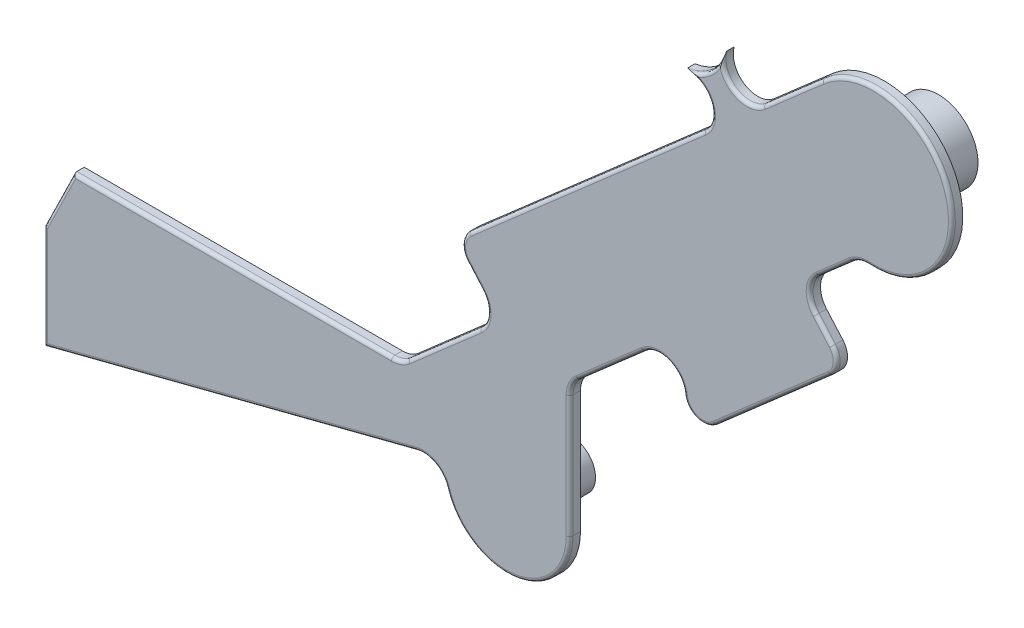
ISO-10303-21;
HEADER;
FILE_DESCRIPTION(('STEP AP214'),'2;1');
FILE_NAME('part.step','',(''),(''),'','','');
FILE_SCHEMA(('AUTOMOTIVE_DESIGN { 1 0 10303 214 1 1 1 1 }'));
ENDSEC;
DATA;
#1=APPLICATION_CONTEXT('core data for automotive mechanical design processes');
#2=APPLICATION_PROTOCOL_DEFINITION('international standard','automotive_design',2000,#1);
#3=PRODUCT_CONTEXT('',#1,'mechanical');
#4=PRODUCT('Part','Part','',(#3));
#5=PRODUCT_RELATED_PRODUCT_CATEGORY('part','',(#4));
#6=PRODUCT_DEFINITION_FORMATION('','',#4);
#7=PRODUCT_DEFINITION_CONTEXT('part definition',#1,'design');
#8=PRODUCT_DEFINITION('design','',#6,#7);
#9=PRODUCT_DEFINITION_SHAPE('','',#8);
#10=(LENGTH_UNIT() NAMED_UNIT(*) SI_UNIT(.MILLI.,.METRE.));
#11=(NAMED_UNIT(*) PLANE_ANGLE_UNIT() SI_UNIT($,.RADIAN.));
#12=(NAMED_UNIT(*) SI_UNIT($,.STERADIAN.) SOLID_ANGLE_UNIT());
#13=UNCERTAINTY_MEASURE_WITH_UNIT(LENGTH_MEASURE(1.E-05),#10,'distance_accuracy_value','');
#14=(GEOMETRIC_REPRESENTATION_CONTEXT(3) GLOBAL_UNCERTAINTY_ASSIGNED_CONTEXT((#13)) GLOBAL_UNIT_ASSIGNED_CONTEXT((#10,
#11,#12)) REPRESENTATION_CONTEXT('',''));
#15=CARTESIAN_POINT('',(0.,0.,0.));
#16=DIRECTION('',(0.,0.,1.));
#17=DIRECTION('',(1.,0.,0.));
#18=AXIS2_PLACEMENT_3D('',#15,#16,#17);
#19=CARTESIAN_POINT('',(72.7910058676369,19.4109220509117,0.));
#20=DIRECTION('',(0.,0.,1.));
#21=DIRECTION('',(1.,0.,0.));
#22=AXIS2_PLACEMENT_3D('',#19,#20,#21);
#23=PLANE('',#22);
#24=CARTESIAN_POINT('',(138.766241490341,91.0147253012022,0.));
#25=DIRECTION('',(0.,0.,-1.));
#26=DIRECTION('',(1.,0.,0.));
#27=AXIS2_PLACEMENT_3D('',#24,#25,#26);
#28=CIRCLE('',#27,5.78531387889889);
#29=CARTESIAN_POINT('',(144.55155536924,91.0147253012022,0.));
#30=VERTEX_POINT('',#29);
#31=EDGE_CURVE('E309',#30,#30,#28,.F.);
#32=ORIENTED_EDGE('',*,*,#31,.T.);
#33=EDGE_LOOP('',(#32));
#34=FACE_BOUND('',#33,.T.);
#35=DIRECTION('',(0.439336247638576,0.898322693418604,0.));
#36=VECTOR('',#35,1.);
#37=CARTESIAN_POINT('',(21.6280175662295,32.9834111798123,0.));
#38=LINE('',#37,#36);
#39=CARTESIAN_POINT('',(17.3175804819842,24.169744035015,0.));
#40=VERTEX_POINT('',#39);
#41=CARTESIAN_POINT('',(21.6280175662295,32.9834111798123,0.));
#42=VERTEX_POINT('',#41);
#43=EDGE_CURVE('E306',#40,#42,#38,.T.);
#44=ORIENTED_EDGE('',*,*,#43,.T.);
#45=DIRECTION('',(1.,0.,0.));
#46=VECTOR('',#45,1.);
#47=CARTESIAN_POINT('',(21.6280175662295,32.9834111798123,0.));
#48=LINE('',#47,#46);
#49=CARTESIAN_POINT('',(68.2018190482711,32.9834111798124,0.));
#50=VERTEX_POINT('',#49);
#51=EDGE_CURVE('E313',#42,#50,#48,.T.);
#52=ORIENTED_EDGE('',*,*,#51,.T.);
#53=CARTESIAN_POINT('',(68.2018190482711,36.5743979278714,0.));
#54=DIRECTION('',(0.,0.,1.));
#55=DIRECTION('',(1.,0.,0.));
#56=AXIS2_PLACEMENT_3D('',#53,#54,#55);
#57=CIRCLE('',#56,3.59098674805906);
#58=CARTESIAN_POINT('',(70.5649927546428,33.8705865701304,0.));
#59=VERTEX_POINT('',#58);
#60=EDGE_CURVE('E319',#50,#59,#57,.T.);
#61=ORIENTED_EDGE('',*,*,#60,.T.);
#62=DIRECTION('',(0.752943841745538,0.65808477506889,0.));
#63=VECTOR('',#62,1.);
#64=CARTESIAN_POINT('',(70.5649927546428,33.8705865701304,0.));
#65=LINE('',#64,#63);
#66=CARTESIAN_POINT('',(81.0525728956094,43.036896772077,0.));
#67=VERTEX_POINT('',#66);
#68=EDGE_CURVE('E334',#59,#67,#65,.T.);
#69=ORIENTED_EDGE('',*,*,#68,.T.);
#70=CARTESIAN_POINT('',(78.6893991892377,45.7407081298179,0.));
#71=DIRECTION('',(0.,0.,1.));
#72=DIRECTION('',(1.,0.,0.));
#73=AXIS2_PLACEMENT_3D('',#70,#71,#72);
#74=CIRCLE('',#73,3.59098674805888);
#75=CARTESIAN_POINT('',(81.3932105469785,48.1038818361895,0.));
#76=VERTEX_POINT('',#75);
#77=EDGE_CURVE('E337',#67,#76,#74,.T.);
#78=ORIENTED_EDGE('',*,*,#77,.T.);
#79=DIRECTION('',(-0.658084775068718,0.752943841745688,0.));
#80=VECTOR('',#79,1.);
#81=CARTESIAN_POINT('',(81.3932105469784,48.1038818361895,0.));
#82=LINE('',#81,#80);
#83=CARTESIAN_POINT('',(79.2284301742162,50.5807026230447,0.));
#84=VERTEX_POINT('',#83);
#85=EDGE_CURVE('E340',#76,#84,#82,.T.);
#86=ORIENTED_EDGE('',*,*,#85,.T.);
#87=CARTESIAN_POINT('',(81.3058122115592,52.3963672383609,0.));
#88=DIRECTION('',(0.,0.,-1.));
#89=DIRECTION('',(1.,0.,0.));
#90=AXIS2_PLACEMENT_3D('',#87,#88,#89);
#91=CIRCLE('',#90,2.75901325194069);
#92=CARTESIAN_POINT('',(79.4901475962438,54.473749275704,0.));
#93=VERTEX_POINT('',#92);
#94=EDGE_CURVE('E343',#84,#93,#91,.T.);
#95=ORIENTED_EDGE('',*,*,#94,.T.);
#96=DIRECTION('',(0.752943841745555,0.65808477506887,0.));
#97=VECTOR('',#96,1.);
#98=CARTESIAN_POINT('',(79.490147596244,54.4737492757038,0.));
#99=LINE('',#98,#97);
#100=CARTESIAN_POINT('',(113.914089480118,84.5608165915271,0.));
#101=VERTEX_POINT('',#100);
#102=EDGE_CURVE('E346',#93,#101,#99,.T.);
#103=ORIENTED_EDGE('',*,*,#102,.T.);
#104=CARTESIAN_POINT('',(111.550915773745,87.2646279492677,0.));
#105=DIRECTION('',(0.,0.,1.));
#106=DIRECTION('',(1.,0.,0.));
#107=AXIS2_PLACEMENT_3D('',#104,#105,#106);
#108=CIRCLE('',#107,3.59098674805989);
#109=CARTESIAN_POINT('',(111.053186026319,90.8209534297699,0.));
#110=VERTEX_POINT('',#109);
#111=EDGE_CURVE('E349',#101,#110,#108,.T.);
#112=ORIENTED_EDGE('',*,*,#111,.T.);
#113=CARTESIAN_POINT('',(110.088666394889,97.7125361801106,0.));
#114=DIRECTION('',(0.,0.,1.));
#115=DIRECTION('',(1.,0.,0.));
#116=AXIS2_PLACEMENT_3D('',#113,#114,#115);
#117=CIRCLE('',#116,6.95875067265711);
#118=CARTESIAN_POINT('',(116.789137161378,95.8342650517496,0.));
#119=VERTEX_POINT('',#118);
#120=EDGE_CURVE('E352',#110,#119,#117,.T.);
#121=ORIENTED_EDGE('',*,*,#120,.T.);
#122=CARTESIAN_POINT('',(120.246841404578,94.8650038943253,0.));
#123=DIRECTION('',(0.,0.,1.));
#124=DIRECTION('',(1.,0.,0.));
#125=AXIS2_PLACEMENT_3D('',#122,#123,#124);
#126=CIRCLE('',#125,3.59098674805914);
#127=CARTESIAN_POINT('',(122.61001511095,92.1611925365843,0.));
#128=VERTEX_POINT('',#127);
#129=EDGE_CURVE('E355',#119,#128,#126,.T.);
#130=ORIENTED_EDGE('',*,*,#129,.T.);
#131=DIRECTION('',(0.752943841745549,0.658084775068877,0.));
#132=VECTOR('',#131,1.);
#133=CARTESIAN_POINT('',(122.61001511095,92.1611925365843,0.));
#134=LINE('',#133,#132);
#135=CARTESIAN_POINT('',(131.201299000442,99.670109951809,0.));
#136=VERTEX_POINT('',#135);
#137=EDGE_CURVE('E358',#128,#136,#134,.T.);
#138=ORIENTED_EDGE('',*,*,#137,.T.);
#139=CARTESIAN_POINT('',(138.766241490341,91.0147253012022,0.));
#140=DIRECTION('',(0.,0.,-1.));
#141=DIRECTION('',(1.,0.,0.));
#142=AXIS2_PLACEMENT_3D('',#139,#140,#141);
#143=CIRCLE('',#142,11.495392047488);
#144=CARTESIAN_POINT('',(138.07791555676,79.539959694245,0.));
#145=VERTEX_POINT('',#144);
#146=EDGE_CURVE('E361',#136,#145,#143,.T.);
#147=ORIENTED_EDGE('',*,*,#146,.T.);
#148=CARTESIAN_POINT('',(137.862892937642,75.9554163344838,0.));
#149=DIRECTION('',(0.,0.,1.));
#150=DIRECTION('',(1.,0.,0.));
#151=AXIS2_PLACEMENT_3D('',#148,#149,#150);
#152=CIRCLE('',#151,3.59098674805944);
#153=CARTESIAN_POINT('',(135.49971923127,78.6592276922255,0.));
#154=VERTEX_POINT('',#153);
#155=EDGE_CURVE('E364',#145,#154,#152,.T.);
#156=ORIENTED_EDGE('',*,*,#155,.T.);
#157=DIRECTION('',(-0.752943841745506,-0.658084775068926,0.));
#158=VECTOR('',#157,1.);
#159=CARTESIAN_POINT('',(135.49971923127,78.6592276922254,0.));
#160=LINE('',#159,#158);
#161=CARTESIAN_POINT('',(130.654468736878,74.4244024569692,0.));
#162=VERTEX_POINT('',#161);
#163=EDGE_CURVE('E367',#154,#162,#160,.T.);
#164=ORIENTED_EDGE('',*,*,#163,.T.);
#165=CARTESIAN_POINT('',(133.017642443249,71.7205910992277,0.));
#166=DIRECTION('',(0.,0.,1.));
#167=DIRECTION('',(1.,0.,0.));
#168=AXIS2_PLACEMENT_3D('',#165,#166,#167);
#169=CIRCLE('',#168,3.59098674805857);
#170=CARTESIAN_POINT('',(130.313831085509,69.3574173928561,0.));
#171=VERTEX_POINT('',#170);
#172=EDGE_CURVE('E370',#162,#171,#169,.T.);
#173=ORIENTED_EDGE('',*,*,#172,.T.);
#174=DIRECTION('',(0.658084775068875,-0.752943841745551,0.));
#175=VECTOR('',#174,1.);
#176=CARTESIAN_POINT('',(130.313831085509,69.3574173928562,0.));
#177=LINE('',#176,#175);
#178=CARTESIAN_POINT('',(132.708130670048,66.6179935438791,0.));
#179=VERTEX_POINT('',#178);
#180=EDGE_CURVE('E373',#171,#179,#177,.T.);
#181=ORIENTED_EDGE('',*,*,#180,.T.);
#182=CARTESIAN_POINT('',(130.630748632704,64.8023289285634,0.));
#183=DIRECTION('',(0.,0.,-1.));
#184=DIRECTION('',(1.,0.,0.));
#185=AXIS2_PLACEMENT_3D('',#182,#183,#184);
#186=CIRCLE('',#185,2.7590132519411);
#187=CARTESIAN_POINT('',(132.44641324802,62.72494689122,0.));
#188=VERTEX_POINT('',#187);
#189=EDGE_CURVE('E376',#179,#188,#186,.T.);
#190=ORIENTED_EDGE('',*,*,#189,.T.);
#191=DIRECTION('',(-0.752943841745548,-0.658084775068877,0.));
#192=VECTOR('',#191,1.);
#193=CARTESIAN_POINT('',(132.44641324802,62.72494689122,0.));
#194=LINE('',#193,#192);
#195=CARTESIAN_POINT('',(115.573451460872,47.9777125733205,0.));
#196=VERTEX_POINT('',#195);
#197=EDGE_CURVE('E379',#188,#196,#194,.T.);
#198=ORIENTED_EDGE('',*,*,#197,.T.);
#199=CARTESIAN_POINT('',(113.757786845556,50.0550946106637,0.));
#200=DIRECTION('',(0.,0.,-1.));
#201=DIRECTION('',(1.,0.,0.));
#202=AXIS2_PLACEMENT_3D('',#199,#200,#201);
#203=CIRCLE('',#202,2.75901325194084);
#204=CARTESIAN_POINT('',(111.01489661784,49.7572568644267,0.));
#205=VERTEX_POINT('',#204);
#206=EDGE_CURVE('E382',#196,#205,#203,.T.);
#207=ORIENTED_EDGE('',*,*,#206,.T.);
#208=CARTESIAN_POINT('',(107.444894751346,49.3696068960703,0.));
#209=DIRECTION('',(0.,0.,1.));
#210=DIRECTION('',(1.,0.,0.));
#211=AXIS2_PLACEMENT_3D('',#208,#209,#210);
#212=CIRCLE('',#211,3.59098674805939);
#213=CARTESIAN_POINT('',(105.081721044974,52.0734182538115,0.));
#214=VERTEX_POINT('',#213);
#215=EDGE_CURVE('E385',#205,#214,#212,.T.);
#216=ORIENTED_EDGE('',*,*,#215,.T.);
#217=DIRECTION('',(-0.752943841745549,-0.658084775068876,0.));
#218=VECTOR('',#217,1.);
#219=CARTESIAN_POINT('',(105.081721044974,52.0734182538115,0.));
#220=LINE('',#219,#218);
#221=CARTESIAN_POINT('',(95.5120246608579,43.709352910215,0.));
#222=VERTEX_POINT('',#221);
#223=EDGE_CURVE('E388',#214,#222,#220,.T.);
#224=ORIENTED_EDGE('',*,*,#223,.T.);
#225=CARTESIAN_POINT('',(97.8751983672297,41.005541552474,0.));
#226=DIRECTION('',(0.,0.,1.));
#227=DIRECTION('',(1.,0.,0.));
#228=AXIS2_PLACEMENT_3D('',#225,#226,#227);
#229=CIRCLE('',#228,3.59098674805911);
#230=CARTESIAN_POINT('',(94.2842116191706,41.005541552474,0.));
#231=VERTEX_POINT('',#230);
#232=EDGE_CURVE('E391',#222,#231,#229,.T.);
#233=ORIENTED_EDGE('',*,*,#232,.T.);
#234=DIRECTION('',(0.,-1.,0.));
#235=VECTOR('',#234,1.);
#236=CARTESIAN_POINT('',(94.2842116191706,41.005541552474,0.));
#237=LINE('',#236,#235);
#238=CARTESIAN_POINT('',(94.2842116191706,23.1127975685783,0.));
#239=VERTEX_POINT('',#238);
#240=EDGE_CURVE('E394',#231,#239,#237,.T.);
#241=ORIENTED_EDGE('',*,*,#240,.T.);
#242=CARTESIAN_POINT('',(85.0599443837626,23.1127975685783,0.));
#243=DIRECTION('',(0.,0.,-1.));
#244=DIRECTION('',(1.,0.,0.));
#245=AXIS2_PLACEMENT_3D('',#242,#243,#244);
#246=CIRCLE('',#245,9.224267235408);
#247=CARTESIAN_POINT('',(76.2289085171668,20.4482316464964,0.));
#248=VERTEX_POINT('',#247);
#249=EDGE_CURVE('E397',#239,#248,#246,.T.);
#250=ORIENTED_EDGE('',*,*,#249,.T.);
#251=CARTESIAN_POINT('',(72.7910058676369,19.4109220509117,0.));
#252=DIRECTION('',(0.,0.,1.));
#253=DIRECTION('',(1.,0.,0.));
#254=AXIS2_PLACEMENT_3D('',#251,#252,#253);
#255=CIRCLE('',#254,3.59098674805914);
#256=CARTESIAN_POINT('',(71.8959679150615,22.8885782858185,0.));
#257=VERTEX_POINT('',#256);
#258=EDGE_CURVE('E400',#248,#257,#255,.T.);
#259=ORIENTED_EDGE('',*,*,#258,.T.);
#260=DIRECTION('',(-0.968440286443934,-0.249245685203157,0.));
#261=VECTOR('',#260,1.);
#262=CARTESIAN_POINT('',(71.8959679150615,22.8885782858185,0.));
#263=LINE('',#262,#261);
#264=CARTESIAN_POINT('',(17.3175804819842,8.84183966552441,0.));
#265=VERTEX_POINT('',#264);
#266=EDGE_CURVE('E403',#257,#265,#263,.T.);
#267=ORIENTED_EDGE('',*,*,#266,.T.);
#268=DIRECTION('',(0.,1.,0.));
#269=VECTOR('',#268,1.);
#270=CARTESIAN_POINT('',(17.3175804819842,24.169744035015,0.));
#271=LINE('',#270,#269);
#272=EDGE_CURVE('E325',#265,#40,#271,.T.);
#273=ORIENTED_EDGE('',*,*,#272,.T.);
#274=EDGE_LOOP('',(#44,#52,#61,#69,#78,#86,#95,#103,#112,#121,#130,#138,#147,#156,#164,#173,
#181,#190,#198,#207,#216,#224,#233,#241,#250,#259,#267,#273));
#275=FACE_BOUND('',#274,.T.);
#276=CARTESIAN_POINT('',(85.0599443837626,23.1127975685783,0.));
#277=DIRECTION('',(0.,0.,-1.));
#278=DIRECTION('',(1.,0.,0.));
#279=AXIS2_PLACEMENT_3D('',#276,#277,#278);
#280=CIRCLE('',#279,3.49249999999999);
#281=CARTESIAN_POINT('',(88.5524443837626,23.1127975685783,0.));
#282=VERTEX_POINT('',#281);
#283=EDGE_CURVE('E461',#282,#282,#280,.F.);
#284=ORIENTED_EDGE('',*,*,#283,.T.);
#285=EDGE_LOOP('',(#284));
#286=FACE_BOUND('',#285,.T.);
#287=ADVANCED_FACE('F32',(#34,#275,#286),#23,.F.);
#288=CARTESIAN_POINT('',(21.6280175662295,32.9834111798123,1.5875));
#289=DIRECTION('',(0.898322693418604,-0.439336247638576,0.));
#290=DIRECTION('',(-0.439336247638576,-0.898322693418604,0.));
#291=AXIS2_PLACEMENT_3D('',#288,#289,#290);
#292=PLANE('',#291);
#293=DIRECTION('',(0.,0.,-1.));
#294=VECTOR('',#293,1.);
#295=CARTESIAN_POINT('',(21.6280175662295,32.9834111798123,1.5875));
#296=LINE('',#295,#294);
#297=CARTESIAN_POINT('',(21.6280175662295,32.9834111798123,1.0795));
#298=VERTEX_POINT('',#297);
#299=EDGE_CURVE('E302',#298,#42,#296,.T.);
#300=ORIENTED_EDGE('',*,*,#299,.T.);
#301=ORIENTED_EDGE('',*,*,#43,.F.);
#302=DIRECTION('',(0.,0.,-1.));
#303=VECTOR('',#302,1.);
#304=CARTESIAN_POINT('',(17.3175804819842,24.169744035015,1.5875));
#305=LINE('',#304,#303);
#306=CARTESIAN_POINT('',(17.3175804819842,24.169744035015,1.0795));
#307=VERTEX_POINT('',#306);
#308=EDGE_CURVE('E406',#307,#40,#305,.T.);
#309=ORIENTED_EDGE('',*,*,#308,.F.);
#310=DIRECTION('',(0.439336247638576,0.898322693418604,0.));
#311=VECTOR('',#310,1.);
#312=CARTESIAN_POINT('',(17.3175804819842,24.169744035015,1.0795));
#313=LINE('',#312,#311);
#314=EDGE_CURVE('E11',#298,#307,#313,.F.);
#315=ORIENTED_EDGE('',*,*,#314,.F.);
#316=EDGE_LOOP('',(#300,#301,#309,#315));
#317=FACE_BOUND('',#316,.T.);
#318=ADVANCED_FACE('F34',(#317),#292,.F.);
#319=CARTESIAN_POINT('',(21.6280175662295,32.9834111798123,1.5875));
#320=DIRECTION('',(0.,-1.,0.));
#321=DIRECTION('',(-1.,0.,0.));
#322=AXIS2_PLACEMENT_3D('',#319,#320,#321);
#323=PLANE('',#322);
#324=DIRECTION('',(0.,0.,-1.));
#325=VECTOR('',#324,1.);
#326=CARTESIAN_POINT('',(68.2018190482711,32.9834111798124,1.5875));
#327=LINE('',#326,#325);
#328=CARTESIAN_POINT('',(68.2018190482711,32.9834111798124,1.0795));
#329=VERTEX_POINT('',#328);
#330=EDGE_CURVE('E310',#329,#50,#327,.T.);
#331=ORIENTED_EDGE('',*,*,#330,.T.);
#332=ORIENTED_EDGE('',*,*,#51,.F.);
#333=ORIENTED_EDGE('',*,*,#299,.F.);
#334=DIRECTION('',(1.,0.,0.));
#335=VECTOR('',#334,1.);
#336=CARTESIAN_POINT('',(21.6280175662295,32.9834111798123,1.0795));
#337=LINE('',#336,#335);
#338=EDGE_CURVE('E40',#329,#298,#337,.F.);
#339=ORIENTED_EDGE('',*,*,#338,.F.);
#340=EDGE_LOOP('',(#331,#332,#333,#339));
#341=FACE_BOUND('',#340,.T.);
#342=ADVANCED_FACE('F314',(#341),#323,.F.);
#343=CARTESIAN_POINT('',(68.2018190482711,36.5743979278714,1.5875));
#344=DIRECTION('',(0.,0.,-1.));
#345=DIRECTION('',(-1.,0.,0.));
#346=AXIS2_PLACEMENT_3D('',#343,#344,#345);
#347=CYLINDRICAL_SURFACE('',#346,3.59098674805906);
#348=DIRECTION('',(0.,0.,-1.));
#349=VECTOR('',#348,1.);
#350=CARTESIAN_POINT('',(70.5649927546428,33.8705865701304,1.5875));
#351=LINE('',#350,#349);
#352=CARTESIAN_POINT('',(70.5649927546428,33.8705865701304,1.0795));
#353=VERTEX_POINT('',#352);
#354=EDGE_CURVE('E456',#353,#59,#351,.T.);
#355=ORIENTED_EDGE('',*,*,#354,.T.);
#356=ORIENTED_EDGE('',*,*,#60,.F.);
#357=ORIENTED_EDGE('',*,*,#330,.F.);
#358=CARTESIAN_POINT('',(68.2018190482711,36.5743979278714,1.0795));
#359=DIRECTION('',(0.,0.,-1.));
#360=DIRECTION('',(1.,0.,0.));
#361=AXIS2_PLACEMENT_3D('',#358,#359,#360);
#362=CIRCLE('',#361,3.59098674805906);
#363=EDGE_CURVE('E621',#353,#329,#362,.T.);
#364=ORIENTED_EDGE('',*,*,#363,.F.);
#365=EDGE_LOOP('',(#355,#356,#357,#364));
#366=FACE_BOUND('',#365,.T.);
#367=ADVANCED_FACE('F625',(#366),#347,.F.);
#368=CARTESIAN_POINT('',(70.5649927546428,33.8705865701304,1.5875));
#369=DIRECTION('',(0.65808477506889,-0.752943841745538,0.));
#370=DIRECTION('',(-0.752943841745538,-0.65808477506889,0.));
#371=AXIS2_PLACEMENT_3D('',#368,#369,#370);
#372=PLANE('',#371);
#373=DIRECTION('',(0.,0.,-1.));
#374=VECTOR('',#373,1.);
#375=CARTESIAN_POINT('',(81.0525728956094,43.036896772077,1.5875));
#376=LINE('',#375,#374);
#377=CARTESIAN_POINT('',(81.0525728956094,43.036896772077,1.0795));
#378=VERTEX_POINT('',#377);
#379=EDGE_CURVE('E454',#378,#67,#376,.T.);
#380=ORIENTED_EDGE('',*,*,#379,.T.);
#381=ORIENTED_EDGE('',*,*,#68,.F.);
#382=ORIENTED_EDGE('',*,*,#354,.F.);
#383=DIRECTION('',(0.752943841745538,0.65808477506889,0.));
#384=VECTOR('',#383,1.);
#385=CARTESIAN_POINT('',(70.5649927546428,33.8705865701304,1.0795));
#386=LINE('',#385,#384);
#387=EDGE_CURVE('E618',#378,#353,#386,.F.);
#388=ORIENTED_EDGE('',*,*,#387,.F.);
#389=EDGE_LOOP('',(#380,#381,#382,#388));
#390=FACE_BOUND('',#389,.T.);
#391=ADVANCED_FACE('F630',(#390),#372,.F.);
#392=CARTESIAN_POINT('',(78.6893991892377,45.7407081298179,1.5875));
#393=DIRECTION('',(0.,0.,-1.));
#394=DIRECTION('',(-1.,0.,0.));
#395=AXIS2_PLACEMENT_3D('',#392,#393,#394);
#396=CYLINDRICAL_SURFACE('',#395,3.59098674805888);
#397=DIRECTION('',(0.,0.,-1.));
#398=VECTOR('',#397,1.);
#399=CARTESIAN_POINT('',(81.3932105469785,48.1038818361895,1.5875));
#400=LINE('',#399,#398);
#401=CARTESIAN_POINT('',(81.3932105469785,48.1038818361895,1.0795));
#402=VERTEX_POINT('',#401);
#403=EDGE_CURVE('E452',#402,#76,#400,.T.);
#404=ORIENTED_EDGE('',*,*,#403,.T.);
#405=ORIENTED_EDGE('',*,*,#77,.F.);
#406=ORIENTED_EDGE('',*,*,#379,.F.);
#407=CARTESIAN_POINT('',(78.6893991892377,45.7407081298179,1.0795));
#408=DIRECTION('',(0.,0.,-1.));
#409=DIRECTION('',(1.,0.,0.));
#410=AXIS2_PLACEMENT_3D('',#407,#408,#409);
#411=CIRCLE('',#410,3.59098674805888);
#412=EDGE_CURVE('E615',#402,#378,#411,.T.);
#413=ORIENTED_EDGE('',*,*,#412,.F.);
#414=EDGE_LOOP('',(#404,#405,#406,#413));
#415=FACE_BOUND('',#414,.T.);
#416=ADVANCED_FACE('F635',(#415),#396,.F.);
#417=CARTESIAN_POINT('',(81.3932105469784,48.1038818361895,1.5875));
#418=DIRECTION('',(0.752943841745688,0.658084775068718,0.));
#419=DIRECTION('',(0.658084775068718,-0.752943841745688,0.));
#420=AXIS2_PLACEMENT_3D('',#417,#418,#419);
#421=PLANE('',#420);
#422=DIRECTION('',(0.,0.,-1.));
#423=VECTOR('',#422,1.);
#424=CARTESIAN_POINT('',(79.2284301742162,50.5807026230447,1.5875));
#425=LINE('',#424,#423);
#426=CARTESIAN_POINT('',(79.2284301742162,50.5807026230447,1.0795));
#427=VERTEX_POINT('',#426);
#428=EDGE_CURVE('E450',#427,#84,#425,.T.);
#429=ORIENTED_EDGE('',*,*,#428,.T.);
#430=ORIENTED_EDGE('',*,*,#85,.F.);
#431=ORIENTED_EDGE('',*,*,#403,.F.);
#432=DIRECTION('',(-0.658084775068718,0.752943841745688,0.));
#433=VECTOR('',#432,1.);
#434=CARTESIAN_POINT('',(81.3932105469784,48.1038818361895,1.0795));
#435=LINE('',#434,#433);
#436=EDGE_CURVE('E612',#427,#402,#435,.F.);
#437=ORIENTED_EDGE('',*,*,#436,.F.);
#438=EDGE_LOOP('',(#429,#430,#431,#437));
#439=FACE_BOUND('',#438,.T.);
#440=ADVANCED_FACE('F640',(#439),#421,.F.);
#441=CARTESIAN_POINT('',(81.3058122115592,52.3963672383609,1.5875));
#442=DIRECTION('',(0.,0.,-1.));
#443=DIRECTION('',(-1.,0.,0.));
#444=AXIS2_PLACEMENT_3D('',#441,#442,#443);
#445=CYLINDRICAL_SURFACE('',#444,2.75901325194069);
#446=DIRECTION('',(0.,0.,-1.));
#447=VECTOR('',#446,1.);
#448=CARTESIAN_POINT('',(79.4901475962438,54.473749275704,1.5875));
#449=LINE('',#448,#447);
#450=CARTESIAN_POINT('',(79.4901475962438,54.473749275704,1.0795));
#451=VERTEX_POINT('',#450);
#452=EDGE_CURVE('E448',#451,#93,#449,.T.);
#453=ORIENTED_EDGE('',*,*,#452,.T.);
#454=ORIENTED_EDGE('',*,*,#94,.F.);
#455=ORIENTED_EDGE('',*,*,#428,.F.);
#456=CARTESIAN_POINT('',(81.3058122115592,52.3963672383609,1.0795));
#457=DIRECTION('',(0.,0.,-1.));
#458=DIRECTION('',(1.,0.,0.));
#459=AXIS2_PLACEMENT_3D('',#456,#457,#458);
#460=CIRCLE('',#459,2.75901325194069);
#461=EDGE_CURVE('E609',#451,#427,#460,.F.);
#462=ORIENTED_EDGE('',*,*,#461,.F.);
#463=EDGE_LOOP('',(#453,#454,#455,#462));
#464=FACE_BOUND('',#463,.T.);
#465=ADVANCED_FACE('F645',(#464),#445,.T.);
#466=CARTESIAN_POINT('',(79.490147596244,54.4737492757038,1.5875));
#467=DIRECTION('',(0.65808477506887,-0.752943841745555,0.));
#468=DIRECTION('',(-0.752943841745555,-0.65808477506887,0.));
#469=AXIS2_PLACEMENT_3D('',#466,#467,#468);
#470=PLANE('',#469);
#471=DIRECTION('',(0.,0.,-1.));
#472=VECTOR('',#471,1.);
#473=CARTESIAN_POINT('',(113.914089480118,84.5608165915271,1.5875));
#474=LINE('',#473,#472);
#475=CARTESIAN_POINT('',(113.914089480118,84.5608165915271,1.0795));
#476=VERTEX_POINT('',#475);
#477=EDGE_CURVE('E446',#476,#101,#474,.T.);
#478=ORIENTED_EDGE('',*,*,#477,.T.);
#479=ORIENTED_EDGE('',*,*,#102,.F.);
#480=ORIENTED_EDGE('',*,*,#452,.F.);
#481=DIRECTION('',(0.752943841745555,0.65808477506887,0.));
#482=VECTOR('',#481,1.);
#483=CARTESIAN_POINT('',(79.490147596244,54.4737492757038,1.0795));
#484=LINE('',#483,#482);
#485=EDGE_CURVE('E606',#476,#451,#484,.F.);
#486=ORIENTED_EDGE('',*,*,#485,.F.);
#487=EDGE_LOOP('',(#478,#479,#480,#486));
#488=FACE_BOUND('',#487,.T.);
#489=ADVANCED_FACE('F650',(#488),#470,.F.);
#490=CARTESIAN_POINT('',(111.550915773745,87.2646279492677,1.5875));
#491=DIRECTION('',(0.,0.,-1.));
#492=DIRECTION('',(-1.,0.,0.));
#493=AXIS2_PLACEMENT_3D('',#490,#491,#492);
#494=CYLINDRICAL_SURFACE('',#493,3.59098674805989);
#495=DIRECTION('',(0.,0.,-1.));
#496=VECTOR('',#495,1.);
#497=CARTESIAN_POINT('',(111.053186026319,90.8209534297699,1.5875));
#498=LINE('',#497,#496);
#499=CARTESIAN_POINT('',(111.053186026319,90.8209534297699,1.0795));
#500=VERTEX_POINT('',#499);
#501=EDGE_CURVE('E444',#500,#110,#498,.T.);
#502=ORIENTED_EDGE('',*,*,#501,.T.);
#503=ORIENTED_EDGE('',*,*,#111,.F.);
#504=ORIENTED_EDGE('',*,*,#477,.F.);
#505=CARTESIAN_POINT('',(111.550915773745,87.2646279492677,1.0795));
#506=DIRECTION('',(0.,0.,-1.));
#507=DIRECTION('',(1.,0.,0.));
#508=AXIS2_PLACEMENT_3D('',#505,#506,#507);
#509=CIRCLE('',#508,3.59098674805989);
#510=EDGE_CURVE('E603',#500,#476,#509,.T.);
#511=ORIENTED_EDGE('',*,*,#510,.F.);
#512=EDGE_LOOP('',(#502,#503,#504,#511));
#513=FACE_BOUND('',#512,.T.);
#514=ADVANCED_FACE('F655',(#513),#494,.F.);
#515=CARTESIAN_POINT('',(110.088666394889,97.7125361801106,1.5875));
#516=DIRECTION('',(0.,0.,-1.));
#517=DIRECTION('',(-1.,0.,0.));
#518=AXIS2_PLACEMENT_3D('',#515,#516,#517);
#519=CYLINDRICAL_SURFACE('',#518,6.95875067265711);
#520=DIRECTION('',(0.,0.,-1.));
#521=VECTOR('',#520,1.);
#522=CARTESIAN_POINT('',(116.789137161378,95.8342650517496,1.5875));
#523=LINE('',#522,#521);
#524=CARTESIAN_POINT('',(116.789137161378,95.8342650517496,1.0795));
#525=VERTEX_POINT('',#524);
#526=EDGE_CURVE('E442',#525,#119,#523,.T.);
#527=ORIENTED_EDGE('',*,*,#526,.T.);
#528=ORIENTED_EDGE('',*,*,#120,.F.);
#529=ORIENTED_EDGE('',*,*,#501,.F.);
#530=CARTESIAN_POINT('',(110.088666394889,97.7125361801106,1.0795));
#531=DIRECTION('',(0.,0.,-1.));
#532=DIRECTION('',(1.,0.,0.));
#533=AXIS2_PLACEMENT_3D('',#530,#531,#532);
#534=CIRCLE('',#533,6.95875067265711);
#535=EDGE_CURVE('E600',#525,#500,#534,.T.);
#536=ORIENTED_EDGE('',*,*,#535,.F.);
#537=EDGE_LOOP('',(#527,#528,#529,#536));
#538=FACE_BOUND('',#537,.T.);
#539=ADVANCED_FACE('F660',(#538),#519,.F.);
#540=CARTESIAN_POINT('',(120.246841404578,94.8650038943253,1.5875));
#541=DIRECTION('',(0.,0.,-1.));
#542=DIRECTION('',(-1.,0.,0.));
#543=AXIS2_PLACEMENT_3D('',#540,#541,#542);
#544=CYLINDRICAL_SURFACE('',#543,3.59098674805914);
#545=DIRECTION('',(0.,0.,-1.));
#546=VECTOR('',#545,1.);
#547=CARTESIAN_POINT('',(122.61001511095,92.1611925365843,1.5875));
#548=LINE('',#547,#546);
#549=CARTESIAN_POINT('',(122.61001511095,92.1611925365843,1.0795));
#550=VERTEX_POINT('',#549);
#551=EDGE_CURVE('E440',#550,#128,#548,.T.);
#552=ORIENTED_EDGE('',*,*,#551,.T.);
#553=ORIENTED_EDGE('',*,*,#129,.F.);
#554=ORIENTED_EDGE('',*,*,#526,.F.);
#555=CARTESIAN_POINT('',(120.246841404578,94.8650038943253,1.0795));
#556=DIRECTION('',(0.,0.,-1.));
#557=DIRECTION('',(1.,0.,0.));
#558=AXIS2_PLACEMENT_3D('',#555,#556,#557);
#559=CIRCLE('',#558,3.59098674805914);
#560=EDGE_CURVE('E597',#550,#525,#559,.T.);
#561=ORIENTED_EDGE('',*,*,#560,.F.);
#562=EDGE_LOOP('',(#552,#553,#554,#561));
#563=FACE_BOUND('',#562,.T.);
#564=ADVANCED_FACE('F665',(#563),#544,.F.);
#565=CARTESIAN_POINT('',(122.61001511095,92.1611925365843,1.5875));
#566=DIRECTION('',(0.658084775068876,-0.752943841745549,0.));
#567=DIRECTION('',(-0.752943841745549,-0.658084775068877,0.));
#568=AXIS2_PLACEMENT_3D('',#565,#566,#567);
#569=PLANE('',#568);
#570=DIRECTION('',(0.,0.,-1.));
#571=VECTOR('',#570,1.);
#572=CARTESIAN_POINT('',(131.201299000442,99.670109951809,1.5875));
#573=LINE('',#572,#571);
#574=CARTESIAN_POINT('',(131.201299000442,99.670109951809,1.0795));
#575=VERTEX_POINT('',#574);
#576=EDGE_CURVE('E438',#575,#136,#573,.T.);
#577=ORIENTED_EDGE('',*,*,#576,.T.);
#578=ORIENTED_EDGE('',*,*,#137,.F.);
#579=ORIENTED_EDGE('',*,*,#551,.F.);
#580=DIRECTION('',(0.752943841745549,0.658084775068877,0.));
#581=VECTOR('',#580,1.);
#582=CARTESIAN_POINT('',(122.61001511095,92.1611925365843,1.0795));
#583=LINE('',#582,#581);
#584=EDGE_CURVE('E594',#575,#550,#583,.F.);
#585=ORIENTED_EDGE('',*,*,#584,.F.);
#586=EDGE_LOOP('',(#577,#578,#579,#585));
#587=FACE_BOUND('',#586,.T.);
#588=ADVANCED_FACE('F670',(#587),#569,.F.);
#589=CARTESIAN_POINT('',(138.766241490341,91.0147253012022,1.5875));
#590=DIRECTION('',(0.,0.,-1.));
#591=DIRECTION('',(-1.,0.,0.));
#592=AXIS2_PLACEMENT_3D('',#589,#590,#591);
#593=CYLINDRICAL_SURFACE('',#592,11.495392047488);
#594=DIRECTION('',(0.,0.,-1.));
#595=VECTOR('',#594,1.);
#596=CARTESIAN_POINT('',(138.07791555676,79.539959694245,1.5875));
#597=LINE('',#596,#595);
#598=CARTESIAN_POINT('',(138.07791555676,79.539959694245,1.0795));
#599=VERTEX_POINT('',#598);
#600=EDGE_CURVE('E436',#599,#145,#597,.T.);
#601=ORIENTED_EDGE('',*,*,#600,.T.);
#602=ORIENTED_EDGE('',*,*,#146,.F.);
#603=ORIENTED_EDGE('',*,*,#576,.F.);
#604=CARTESIAN_POINT('',(138.766241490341,91.0147253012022,1.0795));
#605=DIRECTION('',(0.,0.,-1.));
#606=DIRECTION('',(1.,0.,0.));
#607=AXIS2_PLACEMENT_3D('',#604,#605,#606);
#608=CIRCLE('',#607,11.495392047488);
#609=EDGE_CURVE('E591',#599,#575,#608,.F.);
#610=ORIENTED_EDGE('',*,*,#609,.F.);
#611=EDGE_LOOP('',(#601,#602,#603,#610));
#612=FACE_BOUND('',#611,.T.);
#613=ADVANCED_FACE('F675',(#612),#593,.T.);
#614=CARTESIAN_POINT('',(137.862892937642,75.9554163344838,1.5875));
#615=DIRECTION('',(0.,0.,-1.));
#616=DIRECTION('',(-1.,0.,0.));
#617=AXIS2_PLACEMENT_3D('',#614,#615,#616);
#618=CYLINDRICAL_SURFACE('',#617,3.59098674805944);
#619=DIRECTION('',(0.,0.,-1.));
#620=VECTOR('',#619,1.);
#621=CARTESIAN_POINT('',(135.49971923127,78.6592276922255,1.5875));
#622=LINE('',#621,#620);
#623=CARTESIAN_POINT('',(135.49971923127,78.6592276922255,1.0795));
#624=VERTEX_POINT('',#623);
#625=EDGE_CURVE('E434',#624,#154,#622,.T.);
#626=ORIENTED_EDGE('',*,*,#625,.T.);
#627=ORIENTED_EDGE('',*,*,#155,.F.);
#628=ORIENTED_EDGE('',*,*,#600,.F.);
#629=CARTESIAN_POINT('',(137.862892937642,75.9554163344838,1.0795));
#630=DIRECTION('',(0.,0.,-1.));
#631=DIRECTION('',(1.,0.,0.));
#632=AXIS2_PLACEMENT_3D('',#629,#630,#631);
#633=CIRCLE('',#632,3.59098674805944);
#634=EDGE_CURVE('E588',#624,#599,#633,.T.);
#635=ORIENTED_EDGE('',*,*,#634,.F.);
#636=EDGE_LOOP('',(#626,#627,#628,#635));
#637=FACE_BOUND('',#636,.T.);
#638=ADVANCED_FACE('F680',(#637),#618,.F.);
#639=CARTESIAN_POINT('',(135.49971923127,78.6592276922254,1.5875));
#640=DIRECTION('',(-0.658084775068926,0.752943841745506,0.));
#641=DIRECTION('',(0.752943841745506,0.658084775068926,0.));
#642=AXIS2_PLACEMENT_3D('',#639,#640,#641);
#643=PLANE('',#642);
#644=DIRECTION('',(0.,0.,-1.));
#645=VECTOR('',#644,1.);
#646=CARTESIAN_POINT('',(130.654468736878,74.4244024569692,1.5875));
#647=LINE('',#646,#645);
#648=CARTESIAN_POINT('',(130.654468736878,74.4244024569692,1.0795));
#649=VERTEX_POINT('',#648);
#650=EDGE_CURVE('E432',#649,#162,#647,.T.);
#651=ORIENTED_EDGE('',*,*,#650,.T.);
#652=ORIENTED_EDGE('',*,*,#163,.F.);
#653=ORIENTED_EDGE('',*,*,#625,.F.);
#654=DIRECTION('',(-0.752943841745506,-0.658084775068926,0.));
#655=VECTOR('',#654,1.);
#656=CARTESIAN_POINT('',(135.49971923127,78.6592276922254,1.0795));
#657=LINE('',#656,#655);
#658=EDGE_CURVE('E585',#649,#624,#657,.F.);
#659=ORIENTED_EDGE('',*,*,#658,.F.);
#660=EDGE_LOOP('',(#651,#652,#653,#659));
#661=FACE_BOUND('',#660,.T.);
#662=ADVANCED_FACE('F685',(#661),#643,.F.);
#663=CARTESIAN_POINT('',(133.017642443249,71.7205910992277,1.5875));
#664=DIRECTION('',(0.,0.,-1.));
#665=DIRECTION('',(-1.,0.,0.));
#666=AXIS2_PLACEMENT_3D('',#663,#664,#665);
#667=CYLINDRICAL_SURFACE('',#666,3.59098674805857);
#668=DIRECTION('',(0.,0.,-1.));
#669=VECTOR('',#668,1.);
#670=CARTESIAN_POINT('',(130.313831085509,69.3574173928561,1.5875));
#671=LINE('',#670,#669);
#672=CARTESIAN_POINT('',(130.313831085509,69.3574173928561,1.0795));
#673=VERTEX_POINT('',#672);
#674=EDGE_CURVE('E430',#673,#171,#671,.T.);
#675=ORIENTED_EDGE('',*,*,#674,.T.);
#676=ORIENTED_EDGE('',*,*,#172,.F.);
#677=ORIENTED_EDGE('',*,*,#650,.F.);
#678=CARTESIAN_POINT('',(133.017642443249,71.7205910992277,1.0795));
#679=DIRECTION('',(0.,0.,-1.));
#680=DIRECTION('',(1.,0.,0.));
#681=AXIS2_PLACEMENT_3D('',#678,#679,#680);
#682=CIRCLE('',#681,3.59098674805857);
#683=EDGE_CURVE('E582',#673,#649,#682,.T.);
#684=ORIENTED_EDGE('',*,*,#683,.F.);
#685=EDGE_LOOP('',(#675,#676,#677,#684));
#686=FACE_BOUND('',#685,.T.);
#687=ADVANCED_FACE('F690',(#686),#667,.F.);
#688=CARTESIAN_POINT('',(130.313831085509,69.3574173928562,1.5875));
#689=DIRECTION('',(-0.752943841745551,-0.658084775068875,0.));
#690=DIRECTION('',(-0.658084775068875,0.752943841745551,0.));
#691=AXIS2_PLACEMENT_3D('',#688,#689,#690);
#692=PLANE('',#691);
#693=DIRECTION('',(0.,0.,-1.));
#694=VECTOR('',#693,1.);
#695=CARTESIAN_POINT('',(132.708130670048,66.6179935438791,1.5875));
#696=LINE('',#695,#694);
#697=CARTESIAN_POINT('',(132.708130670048,66.6179935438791,1.0795));
#698=VERTEX_POINT('',#697);
#699=EDGE_CURVE('E428',#698,#179,#696,.T.);
#700=ORIENTED_EDGE('',*,*,#699,.T.);
#701=ORIENTED_EDGE('',*,*,#180,.F.);
#702=ORIENTED_EDGE('',*,*,#674,.F.);
#703=DIRECTION('',(0.658084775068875,-0.752943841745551,0.));
#704=VECTOR('',#703,1.);
#705=CARTESIAN_POINT('',(130.313831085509,69.3574173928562,1.0795));
#706=LINE('',#705,#704);
#707=EDGE_CURVE('E579',#698,#673,#706,.F.);
#708=ORIENTED_EDGE('',*,*,#707,.F.);
#709=EDGE_LOOP('',(#700,#701,#702,#708));
#710=FACE_BOUND('',#709,.T.);
#711=ADVANCED_FACE('F695',(#710),#692,.F.);
#712=CARTESIAN_POINT('',(130.630748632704,64.8023289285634,1.5875));
#713=DIRECTION('',(0.,0.,-1.));
#714=DIRECTION('',(-1.,0.,0.));
#715=AXIS2_PLACEMENT_3D('',#712,#713,#714);
#716=CYLINDRICAL_SURFACE('',#715,2.7590132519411);
#717=DIRECTION('',(0.,0.,-1.));
#718=VECTOR('',#717,1.);
#719=CARTESIAN_POINT('',(132.44641324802,62.72494689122,1.5875));
#720=LINE('',#719,#718);
#721=CARTESIAN_POINT('',(132.44641324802,62.72494689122,1.0795));
#722=VERTEX_POINT('',#721);
#723=EDGE_CURVE('E426',#722,#188,#720,.T.);
#724=ORIENTED_EDGE('',*,*,#723,.T.);
#725=ORIENTED_EDGE('',*,*,#189,.F.);
#726=ORIENTED_EDGE('',*,*,#699,.F.);
#727=CARTESIAN_POINT('',(130.630748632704,64.8023289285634,1.0795));
#728=DIRECTION('',(0.,0.,-1.));
#729=DIRECTION('',(1.,0.,0.));
#730=AXIS2_PLACEMENT_3D('',#727,#728,#729);
#731=CIRCLE('',#730,2.7590132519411);
#732=EDGE_CURVE('E576',#722,#698,#731,.F.);
#733=ORIENTED_EDGE('',*,*,#732,.F.);
#734=EDGE_LOOP('',(#724,#725,#726,#733));
#735=FACE_BOUND('',#734,.T.);
#736=ADVANCED_FACE('F700',(#735),#716,.T.);
#737=CARTESIAN_POINT('',(132.44641324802,62.72494689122,1.5875));
#738=DIRECTION('',(-0.658084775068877,0.752943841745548,0.));
#739=DIRECTION('',(0.752943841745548,0.658084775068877,0.));
#740=AXIS2_PLACEMENT_3D('',#737,#738,#739);
#741=PLANE('',#740);
#742=DIRECTION('',(0.,0.,-1.));
#743=VECTOR('',#742,1.);
#744=CARTESIAN_POINT('',(115.573451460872,47.9777125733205,1.5875));
#745=LINE('',#744,#743);
#746=CARTESIAN_POINT('',(115.573451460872,47.9777125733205,1.0795));
#747=VERTEX_POINT('',#746);
#748=EDGE_CURVE('E424',#747,#196,#745,.T.);
#749=ORIENTED_EDGE('',*,*,#748,.T.);
#750=ORIENTED_EDGE('',*,*,#197,.F.);
#751=ORIENTED_EDGE('',*,*,#723,.F.);
#752=DIRECTION('',(-0.752943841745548,-0.658084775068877,0.));
#753=VECTOR('',#752,1.);
#754=CARTESIAN_POINT('',(132.44641324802,62.72494689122,1.0795));
#755=LINE('',#754,#753);
#756=EDGE_CURVE('E573',#747,#722,#755,.F.);
#757=ORIENTED_EDGE('',*,*,#756,.F.);
#758=EDGE_LOOP('',(#749,#750,#751,#757));
#759=FACE_BOUND('',#758,.T.);
#760=ADVANCED_FACE('F705',(#759),#741,.F.);
#761=CARTESIAN_POINT('',(113.757786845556,50.0550946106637,1.5875));
#762=DIRECTION('',(0.,0.,-1.));
#763=DIRECTION('',(-1.,0.,0.));
#764=AXIS2_PLACEMENT_3D('',#761,#762,#763);
#765=CYLINDRICAL_SURFACE('',#764,2.75901325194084);
#766=DIRECTION('',(0.,0.,-1.));
#767=VECTOR('',#766,1.);
#768=CARTESIAN_POINT('',(111.01489661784,49.7572568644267,1.5875));
#769=LINE('',#768,#767);
#770=CARTESIAN_POINT('',(111.01489661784,49.7572568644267,1.0795));
#771=VERTEX_POINT('',#770);
#772=EDGE_CURVE('E422',#771,#205,#769,.T.);
#773=ORIENTED_EDGE('',*,*,#772,.T.);
#774=ORIENTED_EDGE('',*,*,#206,.F.);
#775=ORIENTED_EDGE('',*,*,#748,.F.);
#776=CARTESIAN_POINT('',(113.757786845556,50.0550946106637,1.0795));
#777=DIRECTION('',(0.,0.,-1.));
#778=DIRECTION('',(1.,0.,0.));
#779=AXIS2_PLACEMENT_3D('',#776,#777,#778);
#780=CIRCLE('',#779,2.75901325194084);
#781=EDGE_CURVE('E570',#771,#747,#780,.F.);
#782=ORIENTED_EDGE('',*,*,#781,.F.);
#783=EDGE_LOOP('',(#773,#774,#775,#782));
#784=FACE_BOUND('',#783,.T.);
#785=ADVANCED_FACE('F710',(#784),#765,.T.);
#786=CARTESIAN_POINT('',(107.444894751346,49.3696068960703,1.5875));
#787=DIRECTION('',(0.,0.,-1.));
#788=DIRECTION('',(-1.,0.,0.));
#789=AXIS2_PLACEMENT_3D('',#786,#787,#788);
#790=CYLINDRICAL_SURFACE('',#789,3.59098674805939);
#791=DIRECTION('',(0.,0.,-1.));
#792=VECTOR('',#791,1.);
#793=CARTESIAN_POINT('',(105.081721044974,52.0734182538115,1.5875));
#794=LINE('',#793,#792);
#795=CARTESIAN_POINT('',(105.081721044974,52.0734182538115,1.0795));
#796=VERTEX_POINT('',#795);
#797=EDGE_CURVE('E420',#796,#214,#794,.T.);
#798=ORIENTED_EDGE('',*,*,#797,.T.);
#799=ORIENTED_EDGE('',*,*,#215,.F.);
#800=ORIENTED_EDGE('',*,*,#772,.F.);
#801=CARTESIAN_POINT('',(107.444894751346,49.3696068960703,1.0795));
#802=DIRECTION('',(0.,0.,-1.));
#803=DIRECTION('',(1.,0.,0.));
#804=AXIS2_PLACEMENT_3D('',#801,#802,#803);
#805=CIRCLE('',#804,3.59098674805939);
#806=EDGE_CURVE('E567',#796,#771,#805,.T.);
#807=ORIENTED_EDGE('',*,*,#806,.F.);
#808=EDGE_LOOP('',(#798,#799,#800,#807));
#809=FACE_BOUND('',#808,.T.);
#810=ADVANCED_FACE('F715',(#809),#790,.F.);
#811=CARTESIAN_POINT('',(105.081721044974,52.0734182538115,1.5875));
#812=DIRECTION('',(-0.658084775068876,0.752943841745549,0.));
#813=DIRECTION('',(0.752943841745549,0.658084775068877,0.));
#814=AXIS2_PLACEMENT_3D('',#811,#812,#813);
#815=PLANE('',#814);
#816=DIRECTION('',(0.,0.,-1.));
#817=VECTOR('',#816,1.);
#818=CARTESIAN_POINT('',(95.5120246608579,43.709352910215,1.5875));
#819=LINE('',#818,#817);
#820=CARTESIAN_POINT('',(95.5120246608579,43.709352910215,1.0795));
#821=VERTEX_POINT('',#820);
#822=EDGE_CURVE('E418',#821,#222,#819,.T.);
#823=ORIENTED_EDGE('',*,*,#822,.T.);
#824=ORIENTED_EDGE('',*,*,#223,.F.);
#825=ORIENTED_EDGE('',*,*,#797,.F.);
#826=DIRECTION('',(-0.752943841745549,-0.658084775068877,0.));
#827=VECTOR('',#826,1.);
#828=CARTESIAN_POINT('',(105.081721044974,52.0734182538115,1.0795));
#829=LINE('',#828,#827);
#830=EDGE_CURVE('E564',#821,#796,#829,.F.);
#831=ORIENTED_EDGE('',*,*,#830,.F.);
#832=EDGE_LOOP('',(#823,#824,#825,#831));
#833=FACE_BOUND('',#832,.T.);
#834=ADVANCED_FACE('F720',(#833),#815,.F.);
#835=CARTESIAN_POINT('',(97.8751983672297,41.005541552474,1.5875));
#836=DIRECTION('',(0.,0.,-1.));
#837=DIRECTION('',(-1.,0.,0.));
#838=AXIS2_PLACEMENT_3D('',#835,#836,#837);
#839=CYLINDRICAL_SURFACE('',#838,3.59098674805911);
#840=DIRECTION('',(0.,0.,-1.));
#841=VECTOR('',#840,1.);
#842=CARTESIAN_POINT('',(94.2842116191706,41.005541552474,1.5875));
#843=LINE('',#842,#841);
#844=CARTESIAN_POINT('',(94.2842116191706,41.005541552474,1.0795));
#845=VERTEX_POINT('',#844);
#846=EDGE_CURVE('E416',#845,#231,#843,.T.);
#847=ORIENTED_EDGE('',*,*,#846,.T.);
#848=ORIENTED_EDGE('',*,*,#232,.F.);
#849=ORIENTED_EDGE('',*,*,#822,.F.);
#850=CARTESIAN_POINT('',(97.8751983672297,41.005541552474,1.0795));
#851=DIRECTION('',(0.,0.,-1.));
#852=DIRECTION('',(1.,0.,0.));
#853=AXIS2_PLACEMENT_3D('',#850,#851,#852);
#854=CIRCLE('',#853,3.59098674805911);
#855=EDGE_CURVE('E561',#845,#821,#854,.T.);
#856=ORIENTED_EDGE('',*,*,#855,.F.);
#857=EDGE_LOOP('',(#847,#848,#849,#856));
#858=FACE_BOUND('',#857,.T.);
#859=ADVANCED_FACE('F725',(#858),#839,.F.);
#860=CARTESIAN_POINT('',(94.2842116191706,41.005541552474,1.5875));
#861=DIRECTION('',(-1.,0.,0.));
#862=DIRECTION('',(0.,0.,1.));
#863=AXIS2_PLACEMENT_3D('',#860,#861,#862);
#864=PLANE('',#863);
#865=DIRECTION('',(0.,0.,-1.));
#866=VECTOR('',#865,1.);
#867=CARTESIAN_POINT('',(94.2842116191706,23.1127975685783,1.5875));
#868=LINE('',#867,#866);
#869=CARTESIAN_POINT('',(94.2842116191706,23.1127975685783,1.0795));
#870=VERTEX_POINT('',#869);
#871=EDGE_CURVE('E414',#870,#239,#868,.T.);
#872=ORIENTED_EDGE('',*,*,#871,.T.);
#873=ORIENTED_EDGE('',*,*,#240,.F.);
#874=ORIENTED_EDGE('',*,*,#846,.F.);
#875=DIRECTION('',(0.,-1.,0.));
#876=VECTOR('',#875,1.);
#877=CARTESIAN_POINT('',(94.2842116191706,41.005541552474,1.0795));
#878=LINE('',#877,#876);
#879=EDGE_CURVE('E558',#870,#845,#878,.F.);
#880=ORIENTED_EDGE('',*,*,#879,.F.);
#881=EDGE_LOOP('',(#872,#873,#874,#880));
#882=FACE_BOUND('',#881,.T.);
#883=ADVANCED_FACE('F730',(#882),#864,.F.);
#884=CARTESIAN_POINT('',(85.0599443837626,23.1127975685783,1.5875));
#885=DIRECTION('',(0.,0.,-1.));
#886=DIRECTION('',(-1.,0.,0.));
#887=AXIS2_PLACEMENT_3D('',#884,#885,#886);
#888=CYLINDRICAL_SURFACE('',#887,9.224267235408);
#889=DIRECTION('',(0.,0.,-1.));
#890=VECTOR('',#889,1.);
#891=CARTESIAN_POINT('',(76.2289085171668,20.4482316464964,1.5875));
#892=LINE('',#891,#890);
#893=CARTESIAN_POINT('',(76.2289085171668,20.4482316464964,1.0795));
#894=VERTEX_POINT('',#893);
#895=EDGE_CURVE('E412',#894,#248,#892,.T.);
#896=ORIENTED_EDGE('',*,*,#895,.T.);
#897=ORIENTED_EDGE('',*,*,#249,.F.);
#898=ORIENTED_EDGE('',*,*,#871,.F.);
#899=CARTESIAN_POINT('',(85.0599443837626,23.1127975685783,1.0795));
#900=DIRECTION('',(0.,0.,-1.));
#901=DIRECTION('',(1.,0.,0.));
#902=AXIS2_PLACEMENT_3D('',#899,#900,#901);
#903=CIRCLE('',#902,9.224267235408);
#904=EDGE_CURVE('E555',#894,#870,#903,.F.);
#905=ORIENTED_EDGE('',*,*,#904,.F.);
#906=EDGE_LOOP('',(#896,#897,#898,#905));
#907=FACE_BOUND('',#906,.T.);
#908=ADVANCED_FACE('F735',(#907),#888,.T.);
#909=CARTESIAN_POINT('',(72.7910058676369,19.4109220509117,1.5875));
#910=DIRECTION('',(0.,0.,-1.));
#911=DIRECTION('',(-1.,0.,0.));
#912=AXIS2_PLACEMENT_3D('',#909,#910,#911);
#913=CYLINDRICAL_SURFACE('',#912,3.59098674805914);
#914=DIRECTION('',(0.,0.,-1.));
#915=VECTOR('',#914,1.);
#916=CARTESIAN_POINT('',(71.8959679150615,22.8885782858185,1.5875));
#917=LINE('',#916,#915);
#918=CARTESIAN_POINT('',(71.8959679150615,22.8885782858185,1.0795));
#919=VERTEX_POINT('',#918);
#920=EDGE_CURVE('E410',#919,#257,#917,.T.);
#921=ORIENTED_EDGE('',*,*,#920,.T.);
#922=ORIENTED_EDGE('',*,*,#258,.F.);
#923=ORIENTED_EDGE('',*,*,#895,.F.);
#924=CARTESIAN_POINT('',(72.7910058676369,19.4109220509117,1.0795));
#925=DIRECTION('',(0.,0.,-1.));
#926=DIRECTION('',(1.,0.,0.));
#927=AXIS2_PLACEMENT_3D('',#924,#925,#926);
#928=CIRCLE('',#927,3.59098674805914);
#929=EDGE_CURVE('E552',#919,#894,#928,.T.);
#930=ORIENTED_EDGE('',*,*,#929,.F.);
#931=EDGE_LOOP('',(#921,#922,#923,#930));
#932=FACE_BOUND('',#931,.T.);
#933=ADVANCED_FACE('F740',(#932),#913,.F.);
#934=CARTESIAN_POINT('',(71.8959679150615,22.8885782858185,1.5875));
#935=DIRECTION('',(-0.249245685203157,0.968440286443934,0.));
#936=DIRECTION('',(0.968440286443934,0.249245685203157,0.));
#937=AXIS2_PLACEMENT_3D('',#934,#935,#936);
#938=PLANE('',#937);
#939=DIRECTION('',(0.,0.,-1.));
#940=VECTOR('',#939,1.);
#941=CARTESIAN_POINT('',(17.3175804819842,8.84183966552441,1.5875));
#942=LINE('',#941,#940);
#943=CARTESIAN_POINT('',(17.3175804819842,8.84183966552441,1.0795));
#944=VERTEX_POINT('',#943);
#945=EDGE_CURVE('E408',#944,#265,#942,.T.);
#946=ORIENTED_EDGE('',*,*,#945,.T.);
#947=ORIENTED_EDGE('',*,*,#266,.F.);
#948=ORIENTED_EDGE('',*,*,#920,.F.);
#949=DIRECTION('',(-0.968440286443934,-0.249245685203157,0.));
#950=VECTOR('',#949,1.);
#951=CARTESIAN_POINT('',(71.8959679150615,22.8885782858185,1.0795));
#952=LINE('',#951,#950);
#953=EDGE_CURVE('E549',#944,#919,#952,.F.);
#954=ORIENTED_EDGE('',*,*,#953,.F.);
#955=EDGE_LOOP('',(#946,#947,#948,#954));
#956=FACE_BOUND('',#955,.T.);
#957=ADVANCED_FACE('F745',(#956),#938,.F.);
#958=CARTESIAN_POINT('',(17.3175804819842,24.169744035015,1.5875));
#959=DIRECTION('',(1.,0.,0.));
#960=DIRECTION('',(0.,0.,-1.));
#961=AXIS2_PLACEMENT_3D('',#958,#959,#960);
#962=PLANE('',#961);
#963=ORIENTED_EDGE('',*,*,#308,.T.);
#964=ORIENTED_EDGE('',*,*,#272,.F.);
#965=ORIENTED_EDGE('',*,*,#945,.F.);
#966=DIRECTION('',(0.,1.,0.));
#967=VECTOR('',#966,1.);
#968=CARTESIAN_POINT('',(17.3175804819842,8.84183966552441,1.0795));
#969=LINE('',#968,#967);
#970=EDGE_CURVE('E546',#307,#944,#969,.F.);
#971=ORIENTED_EDGE('',*,*,#970,.F.);
#972=EDGE_LOOP('',(#963,#964,#965,#971));
#973=FACE_BOUND('',#972,.T.);
#974=ADVANCED_FACE('F749',(#973),#962,.F.);
#975=CARTESIAN_POINT('',(72.7910058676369,19.4109220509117,1.5875));
#976=DIRECTION('',(0.,0.,1.));
#977=DIRECTION('',(1.,0.,0.));
#978=AXIS2_PLACEMENT_3D('',#975,#976,#977);
#979=PLANE('',#978);
#980=DIRECTION('',(-0.968440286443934,-0.249245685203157,0.));
#981=VECTOR('',#980,1.);
#982=CARTESIAN_POINT('',(17.190963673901,9.33380733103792,1.5875));
#983=LINE('',#982,#981);
#984=CARTESIAN_POINT('',(71.7693511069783,23.380545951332,1.5875));
#985=VERTEX_POINT('',#984);
#986=CARTESIAN_POINT('',(17.8255804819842,9.49713748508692,1.5875));
#987=VERTEX_POINT('',#986);
#988=EDGE_CURVE('E540',#985,#987,#983,.T.);
#989=ORIENTED_EDGE('',*,*,#988,.F.);
#990=CARTESIAN_POINT('',(72.7910058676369,19.4109220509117,1.5875));
#991=DIRECTION('',(0.,0.,-1.));
#992=DIRECTION('',(1.,0.,0.));
#993=AXIS2_PLACEMENT_3D('',#990,#991,#992);
#994=CIRCLE('',#993,4.09898674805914);
#995=CARTESIAN_POINT('',(76.7152524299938,20.5949749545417,1.5875));
#996=VERTEX_POINT('',#995);
#997=EDGE_CURVE('E537',#996,#985,#994,.F.);
#998=ORIENTED_EDGE('',*,*,#997,.F.);
#999=CARTESIAN_POINT('',(85.0599443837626,23.1127975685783,1.5875));
#1000=DIRECTION('',(0.,0.,-1.));
#1001=DIRECTION('',(1.,0.,0.));
#1002=AXIS2_PLACEMENT_3D('',#999,#1000,#1001);
#1003=CIRCLE('',#1002,8.716267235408);
#1004=CARTESIAN_POINT('',(93.7762116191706,23.1127975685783,1.5875));
#1005=VERTEX_POINT('',#1004);
#1006=EDGE_CURVE('E534',#1005,#996,#1003,.T.);
#1007=ORIENTED_EDGE('',*,*,#1006,.F.);
#1008=DIRECTION('',(0.,-1.,0.));
#1009=VECTOR('',#1008,1.);
#1010=CARTESIAN_POINT('',(93.7762116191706,23.1127975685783,1.5875));
#1011=LINE('',#1010,#1009);
#1012=CARTESIAN_POINT('',(93.7762116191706,41.005541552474,1.5875));
#1013=VERTEX_POINT('',#1012);
#1014=EDGE_CURVE('E531',#1013,#1005,#1011,.T.);
#1015=ORIENTED_EDGE('',*,*,#1014,.F.);
#1016=CARTESIAN_POINT('',(97.8751983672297,41.005541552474,1.5875));
#1017=DIRECTION('',(0.,0.,-1.));
#1018=DIRECTION('',(1.,0.,0.));
#1019=AXIS2_PLACEMENT_3D('',#1016,#1017,#1018);
#1020=CIRCLE('',#1019,4.09898674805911);
#1021=CARTESIAN_POINT('',(95.1777175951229,44.0918483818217,1.5875));
#1022=VERTEX_POINT('',#1021);
#1023=EDGE_CURVE('E528',#1022,#1013,#1020,.F.);
#1024=ORIENTED_EDGE('',*,*,#1023,.F.);
#1025=DIRECTION('',(-0.752943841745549,-0.658084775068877,0.));
#1026=VECTOR('',#1025,1.);
#1027=CARTESIAN_POINT('',(95.1777175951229,44.0918483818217,1.5875));
#1028=LINE('',#1027,#1026);
#1029=CARTESIAN_POINT('',(104.747413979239,52.4559137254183,1.5875));
#1030=VERTEX_POINT('',#1029);
#1031=EDGE_CURVE('E525',#1030,#1022,#1028,.T.);
#1032=ORIENTED_EDGE('',*,*,#1031,.F.);
#1033=CARTESIAN_POINT('',(107.444894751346,49.3696068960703,1.5875));
#1034=DIRECTION('',(0.,0.,-1.));
#1035=DIRECTION('',(1.,0.,0.));
#1036=AXIS2_PLACEMENT_3D('',#1033,#1034,#1035);
#1037=CIRCLE('',#1036,4.09898674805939);
#1038=CARTESIAN_POINT('',(111.519927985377,49.8120958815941,1.5875));
#1039=VERTEX_POINT('',#1038);
#1040=EDGE_CURVE('E522',#1039,#1030,#1037,.F.);
#1041=ORIENTED_EDGE('',*,*,#1040,.F.);
#1042=CARTESIAN_POINT('',(113.757786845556,50.0550946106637,1.5875));
#1043=DIRECTION('',(0.,0.,-1.));
#1044=DIRECTION('',(1.,0.,0.));
#1045=AXIS2_PLACEMENT_3D('',#1042,#1043,#1044);
#1046=CIRCLE('',#1045,2.25101325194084);
#1047=CARTESIAN_POINT('',(115.239144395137,48.3602080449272,1.5875));
#1048=VERTEX_POINT('',#1047);
#1049=EDGE_CURVE('E519',#1048,#1039,#1046,.T.);
#1050=ORIENTED_EDGE('',*,*,#1049,.F.);
#1051=DIRECTION('',(-0.752943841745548,-0.658084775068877,0.));
#1052=VECTOR('',#1051,1.);
#1053=CARTESIAN_POINT('',(115.239144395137,48.3602080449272,1.5875));
#1054=LINE('',#1053,#1052);
#1055=CARTESIAN_POINT('',(132.112106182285,63.1074423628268,1.5875));
#1056=VERTEX_POINT('',#1055);
#1057=EDGE_CURVE('E516',#1056,#1048,#1054,.T.);
#1058=ORIENTED_EDGE('',*,*,#1057,.F.);
#1059=CARTESIAN_POINT('',(130.630748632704,64.8023289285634,1.5875));
#1060=DIRECTION('',(0.,0.,-1.));
#1061=DIRECTION('',(1.,0.,0.));
#1062=AXIS2_PLACEMENT_3D('',#1059,#1060,#1061);
#1063=CIRCLE('',#1062,2.2510132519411);
#1064=CARTESIAN_POINT('',(132.325635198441,66.2836864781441,1.5875));
#1065=VERTEX_POINT('',#1064);
#1066=EDGE_CURVE('E513',#1065,#1056,#1063,.T.);
#1067=ORIENTED_EDGE('',*,*,#1066,.F.);
#1068=DIRECTION('',(0.658084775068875,-0.752943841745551,0.));
#1069=VECTOR('',#1068,1.);
#1070=CARTESIAN_POINT('',(132.325635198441,66.2836864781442,1.5875));
#1071=LINE('',#1070,#1069);
#1072=CARTESIAN_POINT('',(129.931335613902,69.0231103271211,1.5875));
#1073=VERTEX_POINT('',#1072);
#1074=EDGE_CURVE('E510',#1073,#1065,#1071,.T.);
#1075=ORIENTED_EDGE('',*,*,#1074,.F.);
#1076=CARTESIAN_POINT('',(133.017642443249,71.7205910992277,1.5875));
#1077=DIRECTION('',(0.,0.,-1.));
#1078=DIRECTION('',(1.,0.,0.));
#1079=AXIS2_PLACEMENT_3D('',#1076,#1077,#1078);
#1080=CIRCLE('',#1079,4.09898674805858);
#1081=CARTESIAN_POINT('',(130.320161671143,74.806897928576,1.5875));
#1082=VERTEX_POINT('',#1081);
#1083=EDGE_CURVE('E507',#1082,#1073,#1080,.F.);
#1084=ORIENTED_EDGE('',*,*,#1083,.F.);
#1085=DIRECTION('',(-0.752943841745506,-0.658084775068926,0.));
#1086=VECTOR('',#1085,1.);
#1087=CARTESIAN_POINT('',(130.320161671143,74.8068979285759,1.5875));
#1088=LINE('',#1087,#1086);
#1089=CARTESIAN_POINT('',(135.165412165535,79.0417231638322,1.5875));
#1090=VERTEX_POINT('',#1089);
#1091=EDGE_CURVE('E504',#1090,#1082,#1088,.T.);
#1092=ORIENTED_EDGE('',*,*,#1091,.F.);
#1093=CARTESIAN_POINT('',(137.862892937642,75.9554163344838,1.5875));
#1094=DIRECTION('',(0.,0.,-1.));
#1095=DIRECTION('',(1.,0.,0.));
#1096=AXIS2_PLACEMENT_3D('',#1093,#1094,#1095);
#1097=CIRCLE('',#1096,4.09898674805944);
#1098=CARTESIAN_POINT('',(138.108333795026,80.0470481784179,1.5875));
#1099=VERTEX_POINT('',#1098);
#1100=EDGE_CURVE('E501',#1099,#1090,#1097,.F.);
#1101=ORIENTED_EDGE('',*,*,#1100,.F.);
#1102=CARTESIAN_POINT('',(138.766241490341,91.0147253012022,1.5875));
#1103=DIRECTION('',(0.,0.,-1.));
#1104=DIRECTION('',(1.,0.,0.));
#1105=AXIS2_PLACEMENT_3D('',#1102,#1103,#1104);
#1106=CIRCLE('',#1105,10.987392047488);
#1107=CARTESIAN_POINT('',(131.535606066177,99.2876144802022,1.5875));
#1108=VERTEX_POINT('',#1107);
#1109=EDGE_CURVE('E498',#1108,#1099,#1106,.T.);
#1110=ORIENTED_EDGE('',*,*,#1109,.F.);
#1111=DIRECTION('',(0.752943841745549,0.658084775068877,0.));
#1112=VECTOR('',#1111,1.);
#1113=CARTESIAN_POINT('',(131.535606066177,99.2876144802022,1.5875));
#1114=LINE('',#1113,#1112);
#1115=CARTESIAN_POINT('',(122.944322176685,91.7786970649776,1.5875));
#1116=VERTEX_POINT('',#1115);
#1117=EDGE_CURVE('E495',#1116,#1108,#1114,.T.);
#1118=ORIENTED_EDGE('',*,*,#1117,.F.);
#1119=CARTESIAN_POINT('',(120.246841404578,94.8650038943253,1.5875));
#1120=DIRECTION('',(0.,0.,-1.));
#1121=DIRECTION('',(1.,0.,0.));
#1122=AXIS2_PLACEMENT_3D('',#1119,#1120,#1121);
#1123=CIRCLE('',#1122,4.09898674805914);
#1124=CARTESIAN_POINT('',(116.339034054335,93.6277755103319,1.5875));
#1125=VERTEX_POINT('',#1124);
#1126=EDGE_CURVE('E492',#1125,#1116,#1123,.F.);
#1127=ORIENTED_EDGE('',*,*,#1126,.F.);
#1128=CARTESIAN_POINT('',(110.088666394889,97.7125361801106,1.5875));
#1129=DIRECTION('',(0.,0.,-1.));
#1130=DIRECTION('',(1.,0.,0.));
#1131=AXIS2_PLACEMENT_3D('',#1128,#1129,#1130);
#1132=CIRCLE('',#1131,7.46675067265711);
#1133=CARTESIAN_POINT('',(113.300066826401,90.9716702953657,1.5875));
#1134=VERTEX_POINT('',#1133);
#1135=EDGE_CURVE('E489',#1134,#1125,#1132,.F.);
#1136=ORIENTED_EDGE('',*,*,#1135,.F.);
#1137=CARTESIAN_POINT('',(111.550915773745,87.2646279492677,1.5875));
#1138=DIRECTION('',(0.,0.,-1.));
#1139=DIRECTION('',(1.,0.,0.));
#1140=AXIS2_PLACEMENT_3D('',#1137,#1138,#1139);
#1141=CIRCLE('',#1140,4.09898674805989);
#1142=CARTESIAN_POINT('',(114.248396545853,84.1783211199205,1.5875));
#1143=VERTEX_POINT('',#1142);
#1144=EDGE_CURVE('E486',#1143,#1134,#1141,.F.);
#1145=ORIENTED_EDGE('',*,*,#1144,.F.);
#1146=DIRECTION('',(0.752943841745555,0.65808477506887,0.));
#1147=VECTOR('',#1146,1.);
#1148=CARTESIAN_POINT('',(114.248396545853,84.1783211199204,1.5875));
#1149=LINE('',#1148,#1147);
#1150=CARTESIAN_POINT('',(79.8244546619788,54.0912538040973,1.5875));
#1151=VERTEX_POINT('',#1150);
#1152=EDGE_CURVE('E483',#1151,#1143,#1149,.T.);
#1153=ORIENTED_EDGE('',*,*,#1152,.F.);
#1154=CARTESIAN_POINT('',(81.3058122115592,52.3963672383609,1.5875));
#1155=DIRECTION('',(0.,0.,-1.));
#1156=DIRECTION('',(1.,0.,0.));
#1157=AXIS2_PLACEMENT_3D('',#1154,#1155,#1156);
#1158=CIRCLE('',#1157,2.25101325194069);
#1159=CARTESIAN_POINT('',(79.6109256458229,50.9150096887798,1.5875));
#1160=VERTEX_POINT('',#1159);
#1161=EDGE_CURVE('E480',#1160,#1151,#1158,.T.);
#1162=ORIENTED_EDGE('',*,*,#1161,.F.);
#1163=DIRECTION('',(-0.658084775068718,0.752943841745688,0.));
#1164=VECTOR('',#1163,1.);
#1165=CARTESIAN_POINT('',(79.610925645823,50.9150096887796,1.5875));
#1166=LINE('',#1165,#1164);
#1167=CARTESIAN_POINT('',(81.7757060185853,48.4381889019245,1.5875));
#1168=VERTEX_POINT('',#1167);
#1169=EDGE_CURVE('E477',#1168,#1160,#1166,.T.);
#1170=ORIENTED_EDGE('',*,*,#1169,.F.);
#1171=CARTESIAN_POINT('',(78.6893991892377,45.7407081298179,1.5875));
#1172=DIRECTION('',(0.,0.,-1.));
#1173=DIRECTION('',(1.,0.,0.));
#1174=AXIS2_PLACEMENT_3D('',#1171,#1172,#1173);
#1175=CIRCLE('',#1174,4.09898674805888);
#1176=CARTESIAN_POINT('',(81.3868799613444,42.6544013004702,1.5875));
#1177=VERTEX_POINT('',#1176);
#1178=EDGE_CURVE('E474',#1177,#1168,#1175,.F.);
#1179=ORIENTED_EDGE('',*,*,#1178,.F.);
#1180=DIRECTION('',(0.752943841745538,0.65808477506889,0.));
#1181=VECTOR('',#1180,1.);
#1182=CARTESIAN_POINT('',(81.3868799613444,42.6544013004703,1.5875));
#1183=LINE('',#1182,#1181);
#1184=CARTESIAN_POINT('',(70.8992998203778,33.4880910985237,1.5875));
#1185=VERTEX_POINT('',#1184);
#1186=EDGE_CURVE('E471',#1185,#1177,#1183,.T.);
#1187=ORIENTED_EDGE('',*,*,#1186,.F.);
#1188=CARTESIAN_POINT('',(68.2018190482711,36.5743979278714,1.5875));
#1189=DIRECTION('',(0.,0.,-1.));
#1190=DIRECTION('',(1.,0.,0.));
#1191=AXIS2_PLACEMENT_3D('',#1188,#1189,#1190);
#1192=CIRCLE('',#1191,4.09898674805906);
#1193=CARTESIAN_POINT('',(68.2018190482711,32.4754111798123,1.5875));
#1194=VERTEX_POINT('',#1193);
#1195=EDGE_CURVE('E468',#1194,#1185,#1192,.F.);
#1196=ORIENTED_EDGE('',*,*,#1195,.F.);
#1197=DIRECTION('',(1.,0.,0.));
#1198=VECTOR('',#1197,1.);
#1199=CARTESIAN_POINT('',(68.2018190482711,32.4754111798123,1.5875));
#1200=LINE('',#1199,#1198);
#1201=CARTESIAN_POINT('',(21.9450719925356,32.4754111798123,1.5875));
#1202=VERTEX_POINT('',#1201);
#1203=EDGE_CURVE('E466',#1202,#1194,#1200,.T.);
#1204=ORIENTED_EDGE('',*,*,#1203,.F.);
#1205=DIRECTION('',(0.439336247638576,0.898322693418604,0.));
#1206=VECTOR('',#1205,1.);
#1207=CARTESIAN_POINT('',(22.0843654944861,32.7602283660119,1.5875));
#1208=LINE('',#1207,#1206);
#1209=CARTESIAN_POINT('',(17.8255804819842,24.0521756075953,1.5875));
#1210=VERTEX_POINT('',#1209);
#1211=EDGE_CURVE('E464',#1210,#1202,#1208,.T.);
#1212=ORIENTED_EDGE('',*,*,#1211,.F.);
#1213=DIRECTION('',(0.,1.,0.));
#1214=VECTOR('',#1213,1.);
#1215=CARTESIAN_POINT('',(17.8255804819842,24.169744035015,1.5875));
#1216=LINE('',#1215,#1214);
#1217=EDGE_CURVE('E543',#987,#1210,#1216,.T.);
#1218=ORIENTED_EDGE('',*,*,#1217,.F.);
#1219=EDGE_LOOP('',(#989,#998,#1007,#1015,#1024,#1032,#1041,#1050,#1058,#1067,#1075,#1084,#1092,
#1101,#1110,#1118,#1127,#1136,#1145,#1153,#1162,#1170,#1179,#1187,#1196,#1204,#1212,#1218));
#1220=FACE_BOUND('',#1219,.T.);
#1221=ADVANCED_FACE('F761',(#1220),#979,.T.);
#1222=CARTESIAN_POINT('',(138.766241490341,91.0147253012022,-7.9375));
#1223=DIRECTION('',(0.,0.,1.));
#1224=DIRECTION('',(1.,0.,0.));
#1225=AXIS2_PLACEMENT_3D('',#1222,#1223,#1224);
#1226=CYLINDRICAL_SURFACE('',#1225,5.78531387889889);
#1227=CARTESIAN_POINT('',(138.766241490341,91.0147253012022,-7.9375));
#1228=DIRECTION('',(0.,0.,1.));
#1229=DIRECTION('',(-1.,0.,0.));
#1230=AXIS2_PLACEMENT_3D('',#1227,#1228,#1229);
#1231=CIRCLE('',#1230,5.78531387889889);
#1232=CARTESIAN_POINT('',(132.980927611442,91.0147253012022,-7.9375));
#1233=VERTEX_POINT('',#1232);
#1234=EDGE_CURVE('E326',#1233,#1233,#1231,.T.);
#1235=ORIENTED_EDGE('',*,*,#1234,.T.);
#1236=EDGE_LOOP('',(#1235));
#1237=FACE_BOUND('',#1236,.T.);
#1238=ORIENTED_EDGE('',*,*,#31,.F.);
#1239=EDGE_LOOP('',(#1238));
#1240=FACE_BOUND('',#1239,.T.);
#1241=ADVANCED_FACE('F885',(#1237,#1240),#1226,.T.);
#1242=CARTESIAN_POINT('',(138.766241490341,91.0147253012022,-7.9375));
#1243=DIRECTION('',(0.,0.,-1.));
#1244=DIRECTION('',(-1.,0.,0.));
#1245=AXIS2_PLACEMENT_3D('',#1242,#1243,#1244);
#1246=PLANE('',#1245);
#1247=ORIENTED_EDGE('',*,*,#1234,.F.);
#1248=EDGE_LOOP('',(#1247));
#1249=FACE_BOUND('',#1248,.T.);
#1250=ADVANCED_FACE('F1059',(#1249),#1246,.T.);
#1251=CARTESIAN_POINT('',(85.0599443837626,23.1127975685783,-7.9375));
#1252=DIRECTION('',(0.,0.,1.));
#1253=DIRECTION('',(1.,0.,0.));
#1254=AXIS2_PLACEMENT_3D('',#1251,#1252,#1253);
#1255=CYLINDRICAL_SURFACE('',#1254,3.49249999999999);
#1256=CARTESIAN_POINT('',(85.0599443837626,23.1127975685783,-7.9375));
#1257=DIRECTION('',(0.,0.,1.));
#1258=DIRECTION('',(-1.,0.,0.));
#1259=AXIS2_PLACEMENT_3D('',#1256,#1257,#1258);
#1260=CIRCLE('',#1259,3.49249999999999);
#1261=CARTESIAN_POINT('',(81.5674443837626,23.1127975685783,-7.9375));
#1262=VERTEX_POINT('',#1261);
#1263=EDGE_CURVE('E329',#1262,#1262,#1260,.T.);
#1264=ORIENTED_EDGE('',*,*,#1263,.T.);
#1265=EDGE_LOOP('',(#1264));
#1266=FACE_BOUND('',#1265,.T.);
#1267=ORIENTED_EDGE('',*,*,#283,.F.);
#1268=EDGE_LOOP('',(#1267));
#1269=FACE_BOUND('',#1268,.T.);
#1270=ADVANCED_FACE('F1066',(#1266,#1269),#1255,.T.);
#1271=CARTESIAN_POINT('',(85.0599443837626,23.1127975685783,-7.9375));
#1272=DIRECTION('',(0.,0.,-1.));
#1273=DIRECTION('',(-1.,0.,0.));
#1274=AXIS2_PLACEMENT_3D('',#1271,#1272,#1273);
#1275=PLANE('',#1274);
#1276=ORIENTED_EDGE('',*,*,#1263,.F.);
#1277=EDGE_LOOP('',(#1276));
#1278=FACE_BOUND('',#1277,.T.);
#1279=ADVANCED_FACE('F1073',(#1278),#1275,.T.);
#1280=CARTESIAN_POINT('',(137.862892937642,75.9554163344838,1.0795));
#1281=DIRECTION('',(0.,0.,1.));
#1282=DIRECTION('',(1.,0.,0.));
#1283=AXIS2_PLACEMENT_3D('',#1280,#1281,#1282);
#1284=TOROIDAL_SURFACE('',#1283,4.09898674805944,0.508);
#1285=CARTESIAN_POINT('',(138.108333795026,80.0470481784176,1.0795));
#1286=DIRECTION('',(-0.998205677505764,0.0598784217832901,0.));
#1287=DIRECTION('',(-0.0598784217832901,-0.998205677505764,0.));
#1288=AXIS2_PLACEMENT_3D('',#1285,#1286,#1287);
#1289=CIRCLE('',#1288,0.508);
#1290=EDGE_CURVE('E1374',#599,#1099,#1289,.T.);
#1291=ORIENTED_EDGE('',*,*,#1290,.T.);
#1292=ORIENTED_EDGE('',*,*,#1100,.T.);
#1293=CARTESIAN_POINT('',(135.165412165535,79.0417231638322,1.0795));
#1294=DIRECTION('',(0.752943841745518,0.658084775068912,0.));
#1295=DIRECTION('',(-0.658084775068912,0.752943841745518,0.));
#1296=AXIS2_PLACEMENT_3D('',#1293,#1294,#1295);
#1297=CIRCLE('',#1296,0.508);
#1298=EDGE_CURVE('E1376',#1090,#624,#1297,.T.);
#1299=ORIENTED_EDGE('',*,*,#1298,.T.);
#1300=ORIENTED_EDGE('',*,*,#634,.T.);
#1301=EDGE_LOOP('',(#1291,#1292,#1299,#1300));
#1302=FACE_BOUND('',#1301,.T.);
#1303=ADVANCED_FACE('F1081',(#1302),#1284,.T.);
#1304=CARTESIAN_POINT('',(70.2567231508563,22.3105067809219,1.0795));
#1305=DIRECTION('',(0.752943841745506,0.658084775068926,0.));
#1306=DIRECTION('',(0.658084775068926,-0.752943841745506,0.));
#1307=AXIS2_PLACEMENT_3D('',#1304,#1305,#1306);
#1308=CYLINDRICAL_SURFACE('',#1307,0.508);
#1309=ORIENTED_EDGE('',*,*,#1298,.F.);
#1310=ORIENTED_EDGE('',*,*,#1091,.T.);
#1311=CARTESIAN_POINT('',(130.320161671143,74.806897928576,1.0795));
#1312=DIRECTION('',(0.75294384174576,0.658084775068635,0.));
#1313=DIRECTION('',(-0.658084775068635,0.75294384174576,0.));
#1314=AXIS2_PLACEMENT_3D('',#1311,#1312,#1313);
#1315=CIRCLE('',#1314,0.508);
#1316=EDGE_CURVE('E1372',#1082,#649,#1315,.T.);
#1317=ORIENTED_EDGE('',*,*,#1316,.T.);
#1318=ORIENTED_EDGE('',*,*,#658,.T.);
#1319=EDGE_LOOP('',(#1309,#1310,#1317,#1318));
#1320=FACE_BOUND('',#1319,.T.);
#1321=ADVANCED_FACE('F1089',(#1320),#1308,.T.);
#1322=CARTESIAN_POINT('',(138.766241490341,91.0147253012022,1.0795));
#1323=DIRECTION('',(0.,0.,1.));
#1324=DIRECTION('',(1.,0.,0.));
#1325=AXIS2_PLACEMENT_3D('',#1322,#1323,#1324);
#1326=TOROIDAL_SURFACE('',#1325,10.987392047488,0.508);
#1327=ORIENTED_EDGE('',*,*,#1290,.F.);
#1328=ORIENTED_EDGE('',*,*,#609,.T.);
#1329=CARTESIAN_POINT('',(131.535606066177,99.2876144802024,1.0795));
#1330=DIRECTION('',(0.752943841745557,0.658084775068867,0.));
#1331=DIRECTION('',(-0.658084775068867,0.752943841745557,0.));
#1332=AXIS2_PLACEMENT_3D('',#1329,#1330,#1331);
#1333=CIRCLE('',#1332,0.508);
#1334=EDGE_CURVE('E1370',#575,#1108,#1333,.T.);
#1335=ORIENTED_EDGE('',*,*,#1334,.T.);
#1336=ORIENTED_EDGE('',*,*,#1109,.T.);
#1337=EDGE_LOOP('',(#1327,#1328,#1335,#1336));
#1338=FACE_BOUND('',#1337,.T.);
#1339=ADVANCED_FACE('F1097',(#1338),#1326,.T.);
#1340=CARTESIAN_POINT('',(133.017642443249,71.7205910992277,1.0795));
#1341=DIRECTION('',(0.,0.,1.));
#1342=DIRECTION('',(1.,0.,0.));
#1343=AXIS2_PLACEMENT_3D('',#1340,#1341,#1342);
#1344=TOROIDAL_SURFACE('',#1343,4.09898674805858,0.508);
#1345=ORIENTED_EDGE('',*,*,#1316,.F.);
#1346=ORIENTED_EDGE('',*,*,#1083,.T.);
#1347=CARTESIAN_POINT('',(129.931335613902,69.0231103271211,1.0795));
#1348=DIRECTION('',(-0.658084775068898,0.75294384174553,0.));
#1349=DIRECTION('',(-0.75294384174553,-0.658084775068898,0.));
#1350=AXIS2_PLACEMENT_3D('',#1347,#1348,#1349);
#1351=CIRCLE('',#1350,0.508);
#1352=EDGE_CURVE('E1368',#1073,#673,#1351,.T.);
#1353=ORIENTED_EDGE('',*,*,#1352,.T.);
#1354=ORIENTED_EDGE('',*,*,#683,.T.);
#1355=EDGE_LOOP('',(#1345,#1346,#1353,#1354));
#1356=FACE_BOUND('',#1355,.T.);
#1357=ADVANCED_FACE('F1105',(#1356),#1344,.T.);
#1358=CARTESIAN_POINT('',(58.6528858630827,35.5869692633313,1.0795));
#1359=DIRECTION('',(-0.752943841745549,-0.658084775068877,0.));
#1360=DIRECTION('',(-0.658084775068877,0.752943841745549,0.));
#1361=AXIS2_PLACEMENT_3D('',#1358,#1359,#1360);
#1362=CYLINDRICAL_SURFACE('',#1361,0.508);
#1363=ORIENTED_EDGE('',*,*,#1334,.F.);
#1364=ORIENTED_EDGE('',*,*,#584,.T.);
#1365=CARTESIAN_POINT('',(122.944322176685,91.7786970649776,1.0795));
#1366=DIRECTION('',(0.752943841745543,0.658084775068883,0.));
#1367=DIRECTION('',(-0.658084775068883,0.752943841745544,0.));
#1368=AXIS2_PLACEMENT_3D('',#1365,#1366,#1367);
#1369=CIRCLE('',#1368,0.508);
#1370=EDGE_CURVE('E1366',#550,#1116,#1369,.T.);
#1371=ORIENTED_EDGE('',*,*,#1370,.T.);
#1372=ORIENTED_EDGE('',*,*,#1117,.T.);
#1373=EDGE_LOOP('',(#1363,#1364,#1371,#1372));
#1374=FACE_BOUND('',#1373,.T.);
#1375=ADVANCED_FACE('F1113',(#1374),#1362,.T.);
#1376=CARTESIAN_POINT('',(129.768137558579,69.2098324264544,1.0795));
#1377=DIRECTION('',(-0.658084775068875,0.752943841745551,0.));
#1378=DIRECTION('',(0.752943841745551,0.658084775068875,0.));
#1379=AXIS2_PLACEMENT_3D('',#1376,#1377,#1378);
#1380=CYLINDRICAL_SURFACE('',#1379,0.508);
#1381=ORIENTED_EDGE('',*,*,#1352,.F.);
#1382=ORIENTED_EDGE('',*,*,#1074,.T.);
#1383=CARTESIAN_POINT('',(132.325635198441,66.2836864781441,1.0795));
#1384=DIRECTION('',(-0.658084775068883,0.752943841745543,0.));
#1385=DIRECTION('',(-0.752943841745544,-0.658084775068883,0.));
#1386=AXIS2_PLACEMENT_3D('',#1383,#1384,#1385);
#1387=CIRCLE('',#1386,0.508);
#1388=EDGE_CURVE('E1364',#1065,#698,#1387,.T.);
#1389=ORIENTED_EDGE('',*,*,#1388,.T.);
#1390=ORIENTED_EDGE('',*,*,#707,.T.);
#1391=EDGE_LOOP('',(#1381,#1382,#1389,#1390));
#1392=FACE_BOUND('',#1391,.T.);
#1393=ADVANCED_FACE('F1121',(#1392),#1380,.T.);
#1394=CARTESIAN_POINT('',(120.246841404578,94.8650038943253,1.0795));
#1395=DIRECTION('',(0.,0.,1.));
#1396=DIRECTION('',(1.,0.,0.));
#1397=AXIS2_PLACEMENT_3D('',#1394,#1395,#1396);
#1398=TOROIDAL_SURFACE('',#1397,4.09898674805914,0.508);
#1399=ORIENTED_EDGE('',*,*,#1370,.F.);
#1400=ORIENTED_EDGE('',*,*,#560,.T.);
#1401=CARTESIAN_POINT('',(116.789137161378,95.8342650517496,1.0795));
#1402=CARTESIAN_POINT('',(116.788304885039,95.8312960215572,1.0805097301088));
#1403=CARTESIAN_POINT('',(116.787473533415,95.8283267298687,1.08151946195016));
#1404=CARTESIAN_POINT('',(116.743260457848,95.6702236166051,1.13527827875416));
#1405=CARTESIAN_POINT('',(116.70239869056,95.5143663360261,1.18799485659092));
#1406=CARTESIAN_POINT('',(116.625437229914,95.2002105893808,1.28945270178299));
#1407=CARTESIAN_POINT('',(116.589335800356,95.0419130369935,1.3381954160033));
#1408=CARTESIAN_POINT('',(116.547239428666,94.8430356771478,1.39354709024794));
#1409=CARTESIAN_POINT('',(116.539131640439,94.8040055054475,1.40413239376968));
#1410=CARTESIAN_POINT('',(116.5146703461,94.6839995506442,1.4357067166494));
#1411=CARTESIAN_POINT('',(116.498744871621,94.6026830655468,1.4557511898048));
#1412=CARTESIAN_POINT('',(116.467987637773,94.4391218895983,1.4926368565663));
#1413=CARTESIAN_POINT('',(116.45315576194,94.3568772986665,1.50947839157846));
#1414=CARTESIAN_POINT('',(116.42457929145,94.1915592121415,1.53904943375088));
#1415=CARTESIAN_POINT('',(116.410833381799,94.1084868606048,1.55178397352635));
#1416=CARTESIAN_POINT('',(116.384402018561,93.9415616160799,1.57205010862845));
#1417=CARTESIAN_POINT('',(116.371715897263,93.8577092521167,1.57958500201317));
#1418=CARTESIAN_POINT('',(116.352783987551,93.7267488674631,1.58611098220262));
#1419=CARTESIAN_POINT('',(116.346173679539,93.6798105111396,1.58740783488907));
#1420=CARTESIAN_POINT('',(116.339497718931,93.6311592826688,1.58749841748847));
#1421=CARTESIAN_POINT('',(116.339265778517,93.6294674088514,1.58749999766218));
#1422=CARTESIAN_POINT('',(116.339034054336,93.6277755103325,1.5875));
#1423=B_SPLINE_CURVE_WITH_KNOTS('',3,(#1401,#1402,#1403,#1404,#1405,#1406,#1407,#1408,#1409,
#1410,#1411,#1412,#1413,#1414,#1415,#1416,#1417,#1418,#1419,#1420,#1421,#1422),.UNSPECIFIED.,
.F.,.F.,(4,2,2,2,2,2,2,2,2,2,4),(0.,0.00973378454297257,0.518239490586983,1.02655921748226,
1.15029063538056,1.40598312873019,1.66164835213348,1.9169990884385,2.17218771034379,
2.31438580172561,2.31950889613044),.UNSPECIFIED.);
#1424=EDGE_CURVE('E1359',#525,#1125,#1423,.T.);
#1425=ORIENTED_EDGE('',*,*,#1424,.T.);
#1426=ORIENTED_EDGE('',*,*,#1126,.T.);
#1427=EDGE_LOOP('',(#1399,#1400,#1425,#1426));
#1428=FACE_BOUND('',#1427,.T.);
#1429=ADVANCED_FACE('F1129',(#1428),#1398,.T.);
#1430=CARTESIAN_POINT('',(130.630748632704,64.8023289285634,1.0795));
#1431=DIRECTION('',(0.,0.,1.));
#1432=DIRECTION('',(1.,0.,0.));
#1433=AXIS2_PLACEMENT_3D('',#1430,#1431,#1432);
#1434=TOROIDAL_SURFACE('',#1433,2.2510132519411,0.508);
#1435=ORIENTED_EDGE('',*,*,#1388,.F.);
#1436=ORIENTED_EDGE('',*,*,#1066,.T.);
#1437=CARTESIAN_POINT('',(132.112106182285,63.1074423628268,1.0795));
#1438=DIRECTION('',(0.752943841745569,0.658084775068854,0.));
#1439=DIRECTION('',(-0.658084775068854,0.752943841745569,0.));
#1440=AXIS2_PLACEMENT_3D('',#1437,#1438,#1439);
#1441=CIRCLE('',#1440,0.508);
#1442=EDGE_CURVE('E805',#1056,#722,#1441,.T.);
#1443=ORIENTED_EDGE('',*,*,#1442,.T.);
#1444=ORIENTED_EDGE('',*,*,#732,.T.);
#1445=EDGE_LOOP('',(#1435,#1436,#1443,#1444));
#1446=FACE_BOUND('',#1445,.T.);
#1447=ADVANCED_FACE('F1137',(#1446),#1434,.T.);
#1448=CARTESIAN_POINT('',(110.088666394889,97.7125361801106,1.0795));
#1449=DIRECTION('',(0.,0.,1.));
#1450=DIRECTION('',(1.,0.,0.));
#1451=AXIS2_PLACEMENT_3D('',#1448,#1449,#1450);
#1452=TOROIDAL_SURFACE('',#1451,7.46675067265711,0.508);
#1453=ORIENTED_EDGE('',*,*,#1424,.F.);
#1454=ORIENTED_EDGE('',*,*,#535,.T.);
#1455=CARTESIAN_POINT('',(111.053186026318,90.8209534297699,1.0795));
#1456=CARTESIAN_POINT('',(111.056239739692,90.8213808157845,1.08050973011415));
#1457=CARTESIAN_POINT('',(111.059293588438,90.8218072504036,1.08151946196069));
#1458=CARTESIAN_POINT('',(111.221891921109,90.8444605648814,1.13527827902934));
#1459=CARTESIAN_POINT('',(111.381816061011,90.8640933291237,1.18799485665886));
#1460=CARTESIAN_POINT('',(111.703446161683,90.8983128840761,1.28945270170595));
#1461=CARTESIAN_POINT('',(111.865151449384,90.9129015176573,1.33819541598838));
#1462=CARTESIAN_POINT('',(112.067873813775,90.9279995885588,1.39354709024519));
#1463=CARTESIAN_POINT('',(112.107638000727,90.9308102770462,1.40413239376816));
#1464=CARTESIAN_POINT('',(112.229838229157,90.9389888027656,1.43570671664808));
#1465=CARTESIAN_POINT('',(112.312554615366,90.9438868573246,1.4557511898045));
#1466=CARTESIAN_POINT('',(112.478760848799,90.9524748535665,1.49263685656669));
#1467=CARTESIAN_POINT('',(112.562250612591,90.9561649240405,1.50947839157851));
#1468=CARTESIAN_POINT('',(112.72990605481,90.9623566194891,1.53904943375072));
#1469=CARTESIAN_POINT('',(112.814070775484,90.964859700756,1.55178397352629));
#1470=CARTESIAN_POINT('',(112.98303179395,90.9687104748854,1.57205010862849));
#1471=CARTESIAN_POINT('',(113.067827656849,90.9700589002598,1.5795850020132));
#1472=CARTESIAN_POINT('',(113.200143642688,90.9712915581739,1.58611098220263));
#1473=CARTESIAN_POINT('',(113.247544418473,90.9715597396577,1.58740783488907));
#1474=CARTESIAN_POINT('',(113.296651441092,90.9716637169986,1.58749841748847));
#1475=CARTESIAN_POINT('',(113.298359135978,90.9716671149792,1.58749999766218));
#1476=CARTESIAN_POINT('',(113.3000668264,90.971670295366,1.5875));
#1477=B_SPLINE_CURVE_WITH_KNOTS('',3,(#1455,#1456,#1457,#1458,#1459,#1460,#1461,#1462,#1463,
#1464,#1465,#1466,#1467,#1468,#1469,#1470,#1471,#1472,#1473,#1474,#1475,#1476),.UNSPECIFIED.,
.F.,.F.,(4,2,2,2,2,2,2,2,2,2,4),(0.,0.00973378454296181,0.51823949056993,1.02655921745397,
1.15029063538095,1.40598312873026,1.66164835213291,1.91699908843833,2.17218771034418,
2.31438580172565,2.31950889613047),.UNSPECIFIED.);
#1478=EDGE_CURVE('E798',#500,#1134,#1477,.T.);
#1479=ORIENTED_EDGE('',*,*,#1478,.T.);
#1480=ORIENTED_EDGE('',*,*,#1135,.T.);
#1481=EDGE_LOOP('',(#1453,#1454,#1479,#1480));
#1482=FACE_BOUND('',#1481,.T.);
#1483=ADVANCED_FACE('F807',(#1482),#1452,.T.);
#1484=CARTESIAN_POINT('',(76.8298610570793,14.7898895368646,1.0795));
#1485=DIRECTION('',(0.752943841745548,0.658084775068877,0.));
#1486=DIRECTION('',(0.658084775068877,-0.752943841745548,0.));
#1487=AXIS2_PLACEMENT_3D('',#1484,#1485,#1486);
#1488=CYLINDRICAL_SURFACE('',#1487,0.508);
#1489=ORIENTED_EDGE('',*,*,#1442,.F.);
#1490=ORIENTED_EDGE('',*,*,#1057,.T.);
#1491=CARTESIAN_POINT('',(115.239144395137,48.3602080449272,1.0795));
#1492=DIRECTION('',(0.752943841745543,0.658084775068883,0.));
#1493=DIRECTION('',(-0.658084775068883,0.752943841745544,0.));
#1494=AXIS2_PLACEMENT_3D('',#1491,#1492,#1493);
#1495=CIRCLE('',#1494,0.508);
#1496=EDGE_CURVE('E796',#1048,#747,#1495,.T.);
#1497=ORIENTED_EDGE('',*,*,#1496,.T.);
#1498=ORIENTED_EDGE('',*,*,#756,.T.);
#1499=EDGE_LOOP('',(#1489,#1490,#1497,#1498));
#1500=FACE_BOUND('',#1499,.T.);
#1501=ADVANCED_FACE('F815',(#1500),#1488,.T.);
#1502=CARTESIAN_POINT('',(111.550915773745,87.2646279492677,1.0795));
#1503=DIRECTION('',(0.,0.,1.));
#1504=DIRECTION('',(1.,0.,0.));
#1505=AXIS2_PLACEMENT_3D('',#1502,#1503,#1504);
#1506=TOROIDAL_SURFACE('',#1505,4.09898674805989,0.508);
#1507=ORIENTED_EDGE('',*,*,#1478,.F.);
#1508=ORIENTED_EDGE('',*,*,#510,.T.);
#1509=CARTESIAN_POINT('',(114.248396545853,84.1783211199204,1.0795));
#1510=DIRECTION('',(0.752943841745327,0.658084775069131,0.));
#1511=DIRECTION('',(-0.658084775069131,0.752943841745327,0.));
#1512=AXIS2_PLACEMENT_3D('',#1509,#1510,#1511);
#1513=CIRCLE('',#1512,0.508);
#1514=EDGE_CURVE('E794',#476,#1143,#1513,.T.);
#1515=ORIENTED_EDGE('',*,*,#1514,.T.);
#1516=ORIENTED_EDGE('',*,*,#1144,.T.);
#1517=EDGE_LOOP('',(#1507,#1508,#1515,#1516));
#1518=FACE_BOUND('',#1517,.T.);
#1519=ADVANCED_FACE('F810',(#1518),#1506,.T.);
#1520=CARTESIAN_POINT('',(113.757786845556,50.0550946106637,1.0795));
#1521=DIRECTION('',(0.,0.,1.));
#1522=DIRECTION('',(1.,0.,0.));
#1523=AXIS2_PLACEMENT_3D('',#1520,#1521,#1522);
#1524=TOROIDAL_SURFACE('',#1523,2.25101325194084,0.508);
#1525=ORIENTED_EDGE('',*,*,#1496,.F.);
#1526=ORIENTED_EDGE('',*,*,#1049,.T.);
#1527=CARTESIAN_POINT('',(111.519927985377,49.8120958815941,1.0795));
#1528=DIRECTION('',(0.107950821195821,-0.99415623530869,0.));
#1529=DIRECTION('',(0.99415623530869,0.107950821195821,0.));
#1530=AXIS2_PLACEMENT_3D('',#1527,#1528,#1529);
#1531=CIRCLE('',#1530,0.508);
#1532=EDGE_CURVE('E792',#1039,#771,#1531,.T.);
#1533=ORIENTED_EDGE('',*,*,#1532,.T.);
#1534=ORIENTED_EDGE('',*,*,#781,.T.);
#1535=EDGE_LOOP('',(#1525,#1526,#1533,#1534));
#1536=FACE_BOUND('',#1535,.T.);
#1537=ADVANCED_FACE('F814',(#1536),#1524,.T.);
#1538=CARTESIAN_POINT('',(58.6528858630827,35.5869692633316,1.0795));
#1539=DIRECTION('',(-0.752943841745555,-0.65808477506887,0.));
#1540=DIRECTION('',(-0.65808477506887,0.752943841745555,0.));
#1541=AXIS2_PLACEMENT_3D('',#1538,#1539,#1540);
#1542=CYLINDRICAL_SURFACE('',#1541,0.508);
#1543=ORIENTED_EDGE('',*,*,#1514,.F.);
#1544=ORIENTED_EDGE('',*,*,#485,.T.);
#1545=CARTESIAN_POINT('',(79.824454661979,54.091253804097,1.0795));
#1546=DIRECTION('',(0.752943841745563,0.658084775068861,0.));
#1547=DIRECTION('',(-0.658084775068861,0.752943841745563,0.));
#1548=AXIS2_PLACEMENT_3D('',#1545,#1546,#1547);
#1549=CIRCLE('',#1548,0.508);
#1550=EDGE_CURVE('E790',#451,#1151,#1549,.T.);
#1551=ORIENTED_EDGE('',*,*,#1550,.T.);
#1552=ORIENTED_EDGE('',*,*,#1152,.T.);
#1553=EDGE_LOOP('',(#1543,#1544,#1551,#1552));
#1554=FACE_BOUND('',#1553,.T.);
#1555=ADVANCED_FACE('F819',(#1554),#1542,.T.);
#1556=CARTESIAN_POINT('',(107.444894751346,49.3696068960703,1.0795));
#1557=DIRECTION('',(0.,0.,1.));
#1558=DIRECTION('',(1.,0.,0.));
#1559=AXIS2_PLACEMENT_3D('',#1556,#1557,#1558);
#1560=TOROIDAL_SURFACE('',#1559,4.09898674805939,0.508);
#1561=ORIENTED_EDGE('',*,*,#1532,.F.);
#1562=ORIENTED_EDGE('',*,*,#1040,.T.);
#1563=CARTESIAN_POINT('',(104.747413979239,52.4559137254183,1.0795));
#1564=DIRECTION('',(0.752943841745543,0.658084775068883,0.));
#1565=DIRECTION('',(-0.658084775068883,0.752943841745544,0.));
#1566=AXIS2_PLACEMENT_3D('',#1563,#1564,#1565);
#1567=CIRCLE('',#1566,0.508);
#1568=EDGE_CURVE('E788',#1030,#796,#1567,.T.);
#1569=ORIENTED_EDGE('',*,*,#1568,.T.);
#1570=ORIENTED_EDGE('',*,*,#806,.T.);
#1571=EDGE_LOOP('',(#1561,#1562,#1569,#1570));
#1572=FACE_BOUND('',#1571,.T.);
#1573=ADVANCED_FACE('F823',(#1572),#1560,.T.);
#1574=CARTESIAN_POINT('',(81.3058122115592,52.3963672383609,1.0795));
#1575=DIRECTION('',(0.,0.,1.));
#1576=DIRECTION('',(1.,0.,0.));
#1577=AXIS2_PLACEMENT_3D('',#1574,#1575,#1576);
#1578=TOROIDAL_SURFACE('',#1577,2.25101325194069,0.508);
#1579=ORIENTED_EDGE('',*,*,#1550,.F.);
#1580=ORIENTED_EDGE('',*,*,#461,.T.);
#1581=CARTESIAN_POINT('',(79.6109256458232,50.91500968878,1.0795));
#1582=DIRECTION('',(-0.658084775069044,0.752943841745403,0.));
#1583=DIRECTION('',(-0.752943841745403,-0.658084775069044,0.));
#1584=AXIS2_PLACEMENT_3D('',#1581,#1582,#1583);
#1585=CIRCLE('',#1584,0.508);
#1586=EDGE_CURVE('E786',#427,#1160,#1585,.T.);
#1587=ORIENTED_EDGE('',*,*,#1586,.T.);
#1588=ORIENTED_EDGE('',*,*,#1161,.T.);
#1589=EDGE_LOOP('',(#1579,#1580,#1587,#1588));
#1590=FACE_BOUND('',#1589,.T.);
#1591=ADVANCED_FACE('F827',(#1590),#1578,.T.);
#1592=CARTESIAN_POINT('',(70.2567231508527,22.3105067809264,1.0795));
#1593=DIRECTION('',(0.752943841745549,0.658084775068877,0.));
#1594=DIRECTION('',(0.658084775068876,-0.752943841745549,0.));
#1595=AXIS2_PLACEMENT_3D('',#1592,#1593,#1594);
#1596=CYLINDRICAL_SURFACE('',#1595,0.508);
#1597=ORIENTED_EDGE('',*,*,#1568,.F.);
#1598=ORIENTED_EDGE('',*,*,#1031,.T.);
#1599=CARTESIAN_POINT('',(95.1777175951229,44.0918483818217,1.0795));
#1600=DIRECTION('',(0.752943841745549,0.658084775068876,0.));
#1601=DIRECTION('',(-0.658084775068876,0.752943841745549,0.));
#1602=AXIS2_PLACEMENT_3D('',#1599,#1600,#1601);
#1603=CIRCLE('',#1602,0.508);
#1604=EDGE_CURVE('E784',#1022,#821,#1603,.T.);
#1605=ORIENTED_EDGE('',*,*,#1604,.T.);
#1606=ORIENTED_EDGE('',*,*,#830,.T.);
#1607=EDGE_LOOP('',(#1597,#1598,#1605,#1606));
#1608=FACE_BOUND('',#1607,.T.);
#1609=ADVANCED_FACE('F831',(#1608),#1596,.T.);
#1610=CARTESIAN_POINT('',(92.2676881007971,36.43384904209,1.0795));
#1611=DIRECTION('',(0.658084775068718,-0.752943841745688,0.));
#1612=DIRECTION('',(-0.752943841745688,-0.658084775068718,0.));
#1613=AXIS2_PLACEMENT_3D('',#1610,#1611,#1612);
#1614=CYLINDRICAL_SURFACE('',#1613,0.508);
#1615=ORIENTED_EDGE('',*,*,#1586,.F.);
#1616=ORIENTED_EDGE('',*,*,#436,.T.);
#1617=CARTESIAN_POINT('',(81.7757060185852,48.4381889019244,1.0795));
#1618=DIRECTION('',(-0.658084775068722,0.752943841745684,0.));
#1619=DIRECTION('',(-0.752943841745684,-0.658084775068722,0.));
#1620=AXIS2_PLACEMENT_3D('',#1617,#1618,#1619);
#1621=CIRCLE('',#1620,0.508);
#1622=EDGE_CURVE('E782',#402,#1168,#1621,.T.);
#1623=ORIENTED_EDGE('',*,*,#1622,.T.);
#1624=ORIENTED_EDGE('',*,*,#1169,.T.);
#1625=EDGE_LOOP('',(#1615,#1616,#1623,#1624));
#1626=FACE_BOUND('',#1625,.T.);
#1627=ADVANCED_FACE('F835',(#1626),#1614,.T.);
#1628=CARTESIAN_POINT('',(97.8751983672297,41.005541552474,1.0795));
#1629=DIRECTION('',(0.,0.,1.));
#1630=DIRECTION('',(1.,0.,0.));
#1631=AXIS2_PLACEMENT_3D('',#1628,#1629,#1630);
#1632=TOROIDAL_SURFACE('',#1631,4.09898674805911,0.508);
#1633=ORIENTED_EDGE('',*,*,#1604,.F.);
#1634=ORIENTED_EDGE('',*,*,#1023,.T.);
#1635=CARTESIAN_POINT('',(93.7762116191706,41.005541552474,1.0795));
#1636=DIRECTION('',(0.,1.,0.));
#1637=DIRECTION('',(0.,0.,1.));
#1638=AXIS2_PLACEMENT_3D('',#1635,#1636,#1637);
#1639=CIRCLE('',#1638,0.508);
#1640=EDGE_CURVE('E780',#1013,#845,#1639,.T.);
#1641=ORIENTED_EDGE('',*,*,#1640,.T.);
#1642=ORIENTED_EDGE('',*,*,#855,.T.);
#1643=EDGE_LOOP('',(#1633,#1634,#1641,#1642));
#1644=FACE_BOUND('',#1643,.T.);
#1645=ADVANCED_FACE('F839',(#1644),#1632,.T.);
#1646=CARTESIAN_POINT('',(78.6893991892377,45.7407081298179,1.0795));
#1647=DIRECTION('',(0.,0.,1.));
#1648=DIRECTION('',(1.,0.,0.));
#1649=AXIS2_PLACEMENT_3D('',#1646,#1647,#1648);
#1650=TOROIDAL_SURFACE('',#1649,4.09898674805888,0.508);
#1651=ORIENTED_EDGE('',*,*,#1622,.F.);
#1652=ORIENTED_EDGE('',*,*,#412,.T.);
#1653=CARTESIAN_POINT('',(81.3868799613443,42.6544013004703,1.0795));
#1654=DIRECTION('',(0.752943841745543,0.658084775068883,0.));
#1655=DIRECTION('',(-0.658084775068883,0.752943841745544,0.));
#1656=AXIS2_PLACEMENT_3D('',#1653,#1654,#1655);
#1657=CIRCLE('',#1656,0.508);
#1658=EDGE_CURVE('E778',#378,#1177,#1657,.T.);
#1659=ORIENTED_EDGE('',*,*,#1658,.T.);
#1660=ORIENTED_EDGE('',*,*,#1178,.T.);
#1661=EDGE_LOOP('',(#1651,#1652,#1659,#1660));
#1662=FACE_BOUND('',#1661,.T.);
#1663=ADVANCED_FACE('F843',(#1662),#1650,.T.);
#1664=CARTESIAN_POINT('',(93.7762116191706,19.4109220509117,1.0795));
#1665=DIRECTION('',(0.,1.,0.));
#1666=DIRECTION('',(0.,0.,-1.));
#1667=AXIS2_PLACEMENT_3D('',#1664,#1665,#1666);
#1668=CYLINDRICAL_SURFACE('',#1667,0.508);
#1669=ORIENTED_EDGE('',*,*,#1640,.F.);
#1670=ORIENTED_EDGE('',*,*,#1014,.T.);
#1671=CARTESIAN_POINT('',(93.7762116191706,23.1127975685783,1.0795));
#1672=DIRECTION('',(0.,1.,0.));
#1673=DIRECTION('',(0.,0.,1.));
#1674=AXIS2_PLACEMENT_3D('',#1671,#1672,#1673);
#1675=CIRCLE('',#1674,0.508);
#1676=EDGE_CURVE('E776',#1005,#870,#1675,.T.);
#1677=ORIENTED_EDGE('',*,*,#1676,.T.);
#1678=ORIENTED_EDGE('',*,*,#879,.T.);
#1679=EDGE_LOOP('',(#1669,#1670,#1677,#1678));
#1680=FACE_BOUND('',#1679,.T.);
#1681=ADVANCED_FACE('F847',(#1680),#1668,.T.);
#1682=CARTESIAN_POINT('',(64.9965045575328,28.3289550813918,1.0795));
#1683=DIRECTION('',(-0.752943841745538,-0.65808477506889,0.));
#1684=DIRECTION('',(-0.65808477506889,0.752943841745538,0.));
#1685=AXIS2_PLACEMENT_3D('',#1682,#1683,#1684);
#1686=CYLINDRICAL_SURFACE('',#1685,0.508);
#1687=ORIENTED_EDGE('',*,*,#1658,.F.);
#1688=ORIENTED_EDGE('',*,*,#387,.T.);
#1689=CARTESIAN_POINT('',(70.8992998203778,33.4880910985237,1.0795));
#1690=DIRECTION('',(0.752943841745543,0.658084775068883,0.));
#1691=DIRECTION('',(-0.658084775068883,0.752943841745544,0.));
#1692=AXIS2_PLACEMENT_3D('',#1689,#1690,#1691);
#1693=CIRCLE('',#1692,0.508);
#1694=EDGE_CURVE('E767',#353,#1185,#1693,.T.);
#1695=ORIENTED_EDGE('',*,*,#1694,.T.);
#1696=ORIENTED_EDGE('',*,*,#1186,.T.);
#1697=EDGE_LOOP('',(#1687,#1688,#1695,#1696));
#1698=FACE_BOUND('',#1697,.T.);
#1699=ADVANCED_FACE('F851',(#1698),#1686,.T.);
#1700=CARTESIAN_POINT('',(85.0599443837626,23.1127975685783,1.0795));
#1701=DIRECTION('',(0.,0.,1.));
#1702=DIRECTION('',(1.,0.,0.));
#1703=AXIS2_PLACEMENT_3D('',#1700,#1701,#1702);
#1704=TOROIDAL_SURFACE('',#1703,8.716267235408,0.508);
#1705=ORIENTED_EDGE('',*,*,#1676,.F.);
#1706=ORIENTED_EDGE('',*,*,#1006,.T.);
#1707=CARTESIAN_POINT('',(76.7152524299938,20.5949749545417,1.0795));
#1708=DIRECTION('',(0.288864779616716,-0.957369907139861,0.));
#1709=DIRECTION('',(0.957369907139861,0.288864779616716,0.));
#1710=AXIS2_PLACEMENT_3D('',#1707,#1708,#1709);
#1711=CIRCLE('',#1710,0.508);
#1712=EDGE_CURVE('E768',#996,#894,#1711,.T.);
#1713=ORIENTED_EDGE('',*,*,#1712,.T.);
#1714=ORIENTED_EDGE('',*,*,#904,.T.);
#1715=EDGE_LOOP('',(#1705,#1706,#1713,#1714));
#1716=FACE_BOUND('',#1715,.T.);
#1717=ADVANCED_FACE('F855',(#1716),#1704,.T.);
#1718=CARTESIAN_POINT('',(68.2018190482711,36.5743979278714,1.0795));
#1719=DIRECTION('',(0.,0.,1.));
#1720=DIRECTION('',(1.,0.,0.));
#1721=AXIS2_PLACEMENT_3D('',#1718,#1719,#1720);
#1722=TOROIDAL_SURFACE('',#1721,4.09898674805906,0.508);
#1723=ORIENTED_EDGE('',*,*,#1694,.F.);
#1724=ORIENTED_EDGE('',*,*,#363,.T.);
#1725=CARTESIAN_POINT('',(68.2018190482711,32.4754111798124,1.0795));
#1726=DIRECTION('',(1.,0.,0.));
#1727=DIRECTION('',(0.,0.,1.));
#1728=AXIS2_PLACEMENT_3D('',#1725,#1726,#1727);
#1729=CIRCLE('',#1728,0.508);
#1730=EDGE_CURVE('E53',#329,#1194,#1729,.T.);
#1731=ORIENTED_EDGE('',*,*,#1730,.T.);
#1732=ORIENTED_EDGE('',*,*,#1195,.T.);
#1733=EDGE_LOOP('',(#1723,#1724,#1731,#1732));
#1734=FACE_BOUND('',#1733,.T.);
#1735=ADVANCED_FACE('F766',(#1734),#1722,.T.);
#1736=CARTESIAN_POINT('',(72.7910058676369,19.4109220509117,1.0795));
#1737=DIRECTION('',(0.,0.,1.));
#1738=DIRECTION('',(1.,0.,0.));
#1739=AXIS2_PLACEMENT_3D('',#1736,#1737,#1738);
#1740=TOROIDAL_SURFACE('',#1739,4.09898674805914,0.508);
#1741=ORIENTED_EDGE('',*,*,#1712,.F.);
#1742=ORIENTED_EDGE('',*,*,#997,.T.);
#1743=CARTESIAN_POINT('',(71.7693511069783,23.380545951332,1.0795));
#1744=DIRECTION('',(0.968440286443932,0.249245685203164,0.));
#1745=DIRECTION('',(-0.249245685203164,0.968440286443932,0.));
#1746=AXIS2_PLACEMENT_3D('',#1743,#1744,#1745);
#1747=CIRCLE('',#1746,0.508);
#1748=EDGE_CURVE('E769',#985,#919,#1747,.T.);
#1749=ORIENTED_EDGE('',*,*,#1748,.T.);
#1750=ORIENTED_EDGE('',*,*,#929,.T.);
#1751=EDGE_LOOP('',(#1741,#1742,#1749,#1750));
#1752=FACE_BOUND('',#1751,.T.);
#1753=ADVANCED_FACE('F862',(#1752),#1740,.T.);
#1754=CARTESIAN_POINT('',(72.7910058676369,32.4754111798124,1.0795));
#1755=DIRECTION('',(-1.,0.,0.));
#1756=DIRECTION('',(0.,1.,0.));
#1757=AXIS2_PLACEMENT_3D('',#1754,#1755,#1756);
#1758=CYLINDRICAL_SURFACE('',#1757,0.508);
#1759=ORIENTED_EDGE('',*,*,#1730,.F.);
#1760=ORIENTED_EDGE('',*,*,#338,.T.);
#1761=CARTESIAN_POINT('',(21.9450719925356,32.4754111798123,1.0795));
#1762=DIRECTION('',(0.848332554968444,0.529463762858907,0.));
#1763=DIRECTION('',(0.529463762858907,-0.848332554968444,0.));
#1764=AXIS2_PLACEMENT_3D('',#1761,#1762,#1763);
#1765=ELLIPSE('',#1764,0.598821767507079,0.508);
#1766=EDGE_CURVE('E46',#298,#1202,#1765,.T.);
#1767=ORIENTED_EDGE('',*,*,#1766,.T.);
#1768=ORIENTED_EDGE('',*,*,#1203,.T.);
#1769=EDGE_LOOP('',(#1759,#1760,#1767,#1768));
#1770=FACE_BOUND('',#1769,.T.);
#1771=ADVANCED_FACE('F622',(#1770),#1758,.T.);
#1772=CARTESIAN_POINT('',(71.7693511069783,23.380545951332,1.0795));
#1773=DIRECTION('',(0.968440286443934,0.249245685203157,0.));
#1774=DIRECTION('',(0.249245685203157,-0.968440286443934,0.));
#1775=AXIS2_PLACEMENT_3D('',#1772,#1773,#1774);
#1776=CYLINDRICAL_SURFACE('',#1775,0.508);
#1777=ORIENTED_EDGE('',*,*,#1748,.F.);
#1778=ORIENTED_EDGE('',*,*,#988,.T.);
#1779=CARTESIAN_POINT('',(17.8255804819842,9.49713748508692,1.0795));
#1780=DIRECTION('',(-0.790330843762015,0.612680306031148,0.));
#1781=DIRECTION('',(0.612680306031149,0.790330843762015,0.));
#1782=AXIS2_PLACEMENT_3D('',#1779,#1780,#1781);
#1783=ELLIPSE('',#1782,0.829143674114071,0.508);
#1784=EDGE_CURVE('E755',#987,#944,#1783,.F.);
#1785=ORIENTED_EDGE('',*,*,#1784,.T.);
#1786=ORIENTED_EDGE('',*,*,#953,.T.);
#1787=EDGE_LOOP('',(#1777,#1778,#1785,#1786));
#1788=FACE_BOUND('',#1787,.T.);
#1789=ADVANCED_FACE('F868',(#1788),#1776,.T.);
#1790=CARTESIAN_POINT('',(26.6030619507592,41.9997290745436,1.0795));
#1791=DIRECTION('',(-0.439336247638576,-0.898322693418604,0.));
#1792=DIRECTION('',(-0.898322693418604,0.439336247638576,0.));
#1793=AXIS2_PLACEMENT_3D('',#1790,#1791,#1792);
#1794=CYLINDRICAL_SURFACE('',#1793,0.508);
#1795=ORIENTED_EDGE('',*,*,#1766,.F.);
#1796=ORIENTED_EDGE('',*,*,#314,.T.);
#1797=CARTESIAN_POINT('',(17.8255804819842,24.0521756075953,1.0795));
#1798=DIRECTION('',(0.225474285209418,0.974249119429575,0.));
#1799=DIRECTION('',(-0.974249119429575,0.225474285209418,0.));
#1800=AXIS2_PLACEMENT_3D('',#1797,#1798,#1799);
#1801=ELLIPSE('',#1800,0.521427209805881,0.508);
#1802=EDGE_CURVE('E752',#307,#1210,#1801,.T.);
#1803=ORIENTED_EDGE('',*,*,#1802,.T.);
#1804=ORIENTED_EDGE('',*,*,#1211,.T.);
#1805=EDGE_LOOP('',(#1795,#1796,#1803,#1804));
#1806=FACE_BOUND('',#1805,.T.);
#1807=ADVANCED_FACE('F751',(#1806),#1794,.T.);
#1808=CARTESIAN_POINT('',(17.8255804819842,19.4109220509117,1.0795));
#1809=DIRECTION('',(0.,-1.,0.));
#1810=DIRECTION('',(0.,0.,1.));
#1811=AXIS2_PLACEMENT_3D('',#1808,#1809,#1810);
#1812=CYLINDRICAL_SURFACE('',#1811,0.508);
#1813=ORIENTED_EDGE('',*,*,#1784,.F.);
#1814=ORIENTED_EDGE('',*,*,#1217,.T.);
#1815=ORIENTED_EDGE('',*,*,#1802,.F.);
#1816=ORIENTED_EDGE('',*,*,#970,.T.);
#1817=EDGE_LOOP('',(#1813,#1814,#1815,#1816));
#1818=FACE_BOUND('',#1817,.T.);
#1819=ADVANCED_FACE('F758',(#1818),#1812,.T.);
#1820=CLOSED_SHELL('',(#287,#318,#342,#367,#391,#416,#440,#465,#489,#514,#539,#564,#588,#613,
#638,#662,#687,#711,#736,#760,#785,#810,#834,#859,#883,#908,#933,#957,#974,#1221,#1241,#1250,
#1270,#1279,#1303,#1321,#1339,#1357,#1375,#1393,#1429,#1447,#1483,#1501,#1519,#1537,#1555,#1573,
#1591,#1609,#1627,#1645,#1663,#1681,#1699,#1717,#1735,#1753,#1771,#1789,#1807,#1819));
#1821=MANIFOLD_SOLID_BREP('B2',#1820);
#1822=ADVANCED_BREP_SHAPE_REPRESENTATION('',(#18,#1821),#14);
#1823=SHAPE_DEFINITION_REPRESENTATION(#9,#1822);
ENDSEC;
END-ISO-10303-21;
